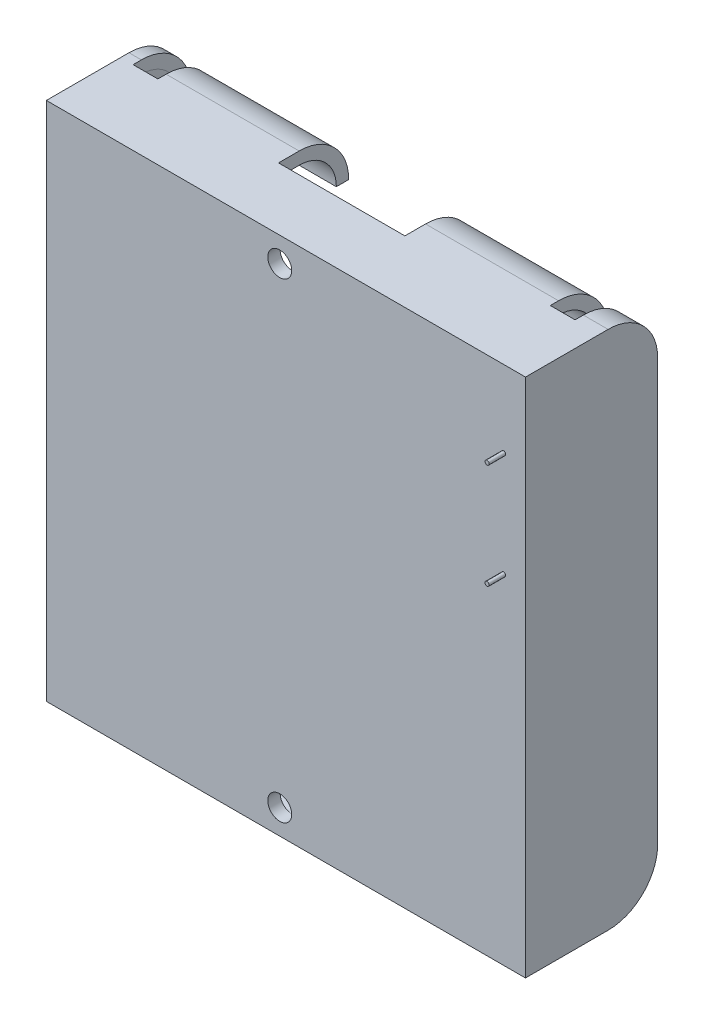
ISO-10303-21;
HEADER;
FILE_DESCRIPTION(('STEP AP214'),'2;1');
FILE_NAME('part.step','',(''),(''),'','','');
FILE_SCHEMA(('AUTOMOTIVE_DESIGN { 1 0 10303 214 1 1 1 1 }'));
ENDSEC;
DATA;
#1=APPLICATION_CONTEXT('core data for automotive mechanical design processes');
#2=APPLICATION_PROTOCOL_DEFINITION('international standard','automotive_design',2000,#1);
#3=PRODUCT_CONTEXT('',#1,'mechanical');
#4=PRODUCT('Part','Part','',(#3));
#5=PRODUCT_RELATED_PRODUCT_CATEGORY('part','',(#4));
#6=PRODUCT_DEFINITION_FORMATION('','',#4);
#7=PRODUCT_DEFINITION_CONTEXT('part definition',#1,'design');
#8=PRODUCT_DEFINITION('design','',#6,#7);
#9=PRODUCT_DEFINITION_SHAPE('','',#8);
#10=(LENGTH_UNIT() NAMED_UNIT(*) SI_UNIT(.MILLI.,.METRE.));
#11=(NAMED_UNIT(*) PLANE_ANGLE_UNIT() SI_UNIT($,.RADIAN.));
#12=(NAMED_UNIT(*) SI_UNIT($,.STERADIAN.) SOLID_ANGLE_UNIT());
#13=UNCERTAINTY_MEASURE_WITH_UNIT(LENGTH_MEASURE(1.E-05),#10,'distance_accuracy_value','');
#14=(GEOMETRIC_REPRESENTATION_CONTEXT(3) GLOBAL_UNCERTAINTY_ASSIGNED_CONTEXT((#13)) GLOBAL_UNIT_ASSIGNED_CONTEXT((#10,
#11,#12)) REPRESENTATION_CONTEXT('',''));
#15=CARTESIAN_POINT('',(0.,0.,0.));
#16=DIRECTION('',(0.,0.,1.));
#17=DIRECTION('',(1.,0.,0.));
#18=AXIS2_PLACEMENT_3D('',#15,#16,#17);
#19=CARTESIAN_POINT('',(-28.25,34.2499997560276,-16.));
#20=DIRECTION('',(0.,0.,1.));
#21=DIRECTION('',(1.,0.,0.));
#22=AXIS2_PLACEMENT_3D('',#19,#20,#21);
#23=PLANE('',#22);
#24=DIRECTION('',(-1.,0.,0.));
#25=VECTOR('',#24,1.);
#26=CARTESIAN_POINT('',(28.2484490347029,-13.0500002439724,-16.));
#27=LINE('',#26,#25);
#28=CARTESIAN_POINT('',(28.2453273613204,-13.0500002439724,-16.));
#29=VERTEX_POINT('',#28);
#30=CARTESIAN_POINT('',(28.244369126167,-13.0500002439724,-16.));
#31=VERTEX_POINT('',#30);
#32=EDGE_CURVE('E614',#29,#31,#27,.T.);
#33=ORIENTED_EDGE('',*,*,#32,.T.);
#34=DIRECTION('',(0.,-1.,0.));
#35=VECTOR('',#34,1.);
#36=CARTESIAN_POINT('',(28.244369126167,21.9499997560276,-16.));
#37=LINE('',#36,#35);
#38=CARTESIAN_POINT('',(28.244369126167,-12.0500002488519,-16.));
#39=VERTEX_POINT('',#38);
#40=EDGE_CURVE('E511',#39,#31,#37,.T.);
#41=ORIENTED_EDGE('',*,*,#40,.F.);
#42=DIRECTION('',(1.,0.,0.));
#43=VECTOR('',#42,1.);
#44=CARTESIAN_POINT('',(28.248350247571,-12.0500002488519,-16.));
#45=LINE('',#44,#43);
#46=CARTESIAN_POINT('',(28.2454261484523,-12.0500002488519,-16.));
#47=VERTEX_POINT('',#46);
#48=EDGE_CURVE('E616',#39,#47,#45,.T.);
#49=ORIENTED_EDGE('',*,*,#48,.T.);
#50=DIRECTION('',(9.87871318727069E-05,0.999999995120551,0.));
#51=VECTOR('',#50,1.);
#52=CARTESIAN_POINT('',(28.2499994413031,34.2444182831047,-16.));
#53=LINE('',#52,#51);
#54=CARTESIAN_POINT('',(28.2468388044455,2.24999975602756,-16.));
#55=VERTEX_POINT('',#54);
#56=EDGE_CURVE('E947',#47,#55,#53,.T.);
#57=ORIENTED_EDGE('',*,*,#56,.T.);
#58=DIRECTION('',(-1.,0.,0.));
#59=VECTOR('',#58,1.);
#60=CARTESIAN_POINT('',(28.248350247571,2.24999975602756,-16.));
#61=LINE('',#60,#59);
#62=CARTESIAN_POINT('',(28.244369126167,2.24999975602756,-16.));
#63=VERTEX_POINT('',#62);
#64=EDGE_CURVE('E590',#55,#63,#61,.T.);
#65=ORIENTED_EDGE('',*,*,#64,.T.);
#66=CARTESIAN_POINT('',(28.244369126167,3.24999975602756,-16.));
#67=VERTEX_POINT('',#66);
#68=EDGE_CURVE('E529',#67,#63,#37,.T.);
#69=ORIENTED_EDGE('',*,*,#68,.F.);
#70=DIRECTION('',(1.,0.,0.));
#71=VECTOR('',#70,1.);
#72=CARTESIAN_POINT('',(28.248350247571,3.24999975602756,-16.));
#73=LINE('',#72,#71);
#74=CARTESIAN_POINT('',(28.2469375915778,3.24999975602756,-16.));
#75=VERTEX_POINT('',#74);
#76=EDGE_CURVE('E593',#67,#75,#73,.T.);
#77=ORIENTED_EDGE('',*,*,#76,.T.);
#78=CARTESIAN_POINT('',(28.248350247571,17.549999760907,-16.));
#79=VERTEX_POINT('',#78);
#80=EDGE_CURVE('E948',#75,#79,#53,.T.);
#81=ORIENTED_EDGE('',*,*,#80,.T.);
#82=DIRECTION('',(-1.,0.,0.));
#83=VECTOR('',#82,1.);
#84=CARTESIAN_POINT('',(28.248350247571,17.549999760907,-16.));
#85=LINE('',#84,#83);
#86=CARTESIAN_POINT('',(28.244369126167,17.549999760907,-16.));
#87=VERTEX_POINT('',#86);
#88=EDGE_CURVE('E631',#79,#87,#85,.T.);
#89=ORIENTED_EDGE('',*,*,#88,.T.);
#90=CARTESIAN_POINT('',(28.244369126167,18.5499997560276,-16.));
#91=VERTEX_POINT('',#90);
#92=EDGE_CURVE('E531',#91,#87,#37,.T.);
#93=ORIENTED_EDGE('',*,*,#92,.F.);
#94=DIRECTION('',(1.,0.,0.));
#95=VECTOR('',#94,1.);
#96=CARTESIAN_POINT('',(28.2484490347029,18.5499997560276,-16.));
#97=LINE('',#96,#95);
#98=CARTESIAN_POINT('',(28.2484490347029,18.5499997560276,-16.));
#99=VERTEX_POINT('',#98);
#100=EDGE_CURVE('E634',#91,#99,#97,.T.);
#101=ORIENTED_EDGE('',*,*,#100,.T.);
#102=CARTESIAN_POINT('',(28.2494072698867,28.2499997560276,-16.));
#103=VERTEX_POINT('',#102);
#104=EDGE_CURVE('E931',#99,#103,#53,.T.);
#105=ORIENTED_EDGE('',*,*,#104,.T.);
#106=DIRECTION('',(-1.,0.,0.));
#107=VECTOR('',#106,1.);
#108=CARTESIAN_POINT('',(29.75,28.2499997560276,-16.));
#109=LINE('',#108,#107);
#110=CARTESIAN_POINT('',(29.7494072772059,28.2499997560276,-16.));
#111=VERTEX_POINT('',#110);
#112=EDGE_CURVE('E991',#103,#111,#109,.F.);
#113=ORIENTED_EDGE('',*,*,#112,.T.);
#114=DIRECTION('',(9.87871318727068E-05,0.999999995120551,0.));
#115=VECTOR('',#114,1.);
#116=CARTESIAN_POINT('',(29.75,34.2499997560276,-16.));
#117=LINE('',#116,#115);
#118=CARTESIAN_POINT('',(29.7443691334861,-22.7499999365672,-16.));
#119=VERTEX_POINT('',#118);
#120=EDGE_CURVE('E971',#119,#111,#117,.T.);
#121=ORIENTED_EDGE('',*,*,#120,.F.);
#122=DIRECTION('',(1.,0.,0.));
#123=VECTOR('',#122,1.);
#124=CARTESIAN_POINT('',(-28.256223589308,-22.7499999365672,-16.));
#125=LINE('',#124,#123);
#126=CARTESIAN_POINT('',(28.244369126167,-22.7499999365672,-16.));
#127=VERTEX_POINT('',#126);
#128=EDGE_CURVE('E996',#119,#127,#125,.F.);
#129=ORIENTED_EDGE('',*,*,#128,.T.);
#130=EDGE_CURVE('E887',#127,#29,#53,.T.);
#131=ORIENTED_EDGE('',*,*,#130,.T.);
#132=EDGE_LOOP('',(#33,#41,#49,#57,#65,#69,#77,#81,#89,#93,#101,#105,#113,#121,#129,#131));
#133=FACE_BOUND('',#132,.T.);
#134=ADVANCED_FACE('F32',(#133),#23,.F.);
#135=CARTESIAN_POINT('',(28.2500000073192,34.2501479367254,-16.));
#136=DIRECTION('',(0.999999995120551,-9.87871318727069E-05,0.));
#137=DIRECTION('',(9.87871318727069E-05,0.999999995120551,0.));
#138=AXIS2_PLACEMENT_3D('',#135,#136,#137);
#139=PLANE('',#138);
#140=DIRECTION('',(0.,0.,1.));
#141=VECTOR('',#140,1.);
#142=CARTESIAN_POINT('',(28.2468388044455,2.24999975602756,-16.));
#143=LINE('',#142,#141);
#144=CARTESIAN_POINT('',(28.2468388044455,2.24999975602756,-1.5));
#145=VERTEX_POINT('',#144);
#146=EDGE_CURVE('E603',#55,#145,#143,.T.);
#147=ORIENTED_EDGE('',*,*,#146,.F.);
#148=ORIENTED_EDGE('',*,*,#56,.F.);
#149=DIRECTION('',(0.,0.,-1.));
#150=VECTOR('',#149,1.);
#151=CARTESIAN_POINT('',(28.2454261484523,-12.0500002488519,-16.));
#152=LINE('',#151,#150);
#153=CARTESIAN_POINT('',(28.2454261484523,-12.0500002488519,-1.5));
#154=VERTEX_POINT('',#153);
#155=EDGE_CURVE('E622',#154,#47,#152,.T.);
#156=ORIENTED_EDGE('',*,*,#155,.F.);
#157=DIRECTION('',(9.87871318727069E-05,0.999999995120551,0.));
#158=VECTOR('',#157,1.);
#159=CARTESIAN_POINT('',(28.2499994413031,34.2444182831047,-1.5));
#160=LINE('',#159,#158);
#161=EDGE_CURVE('E920',#154,#145,#160,.T.);
#162=ORIENTED_EDGE('',*,*,#161,.T.);
#163=EDGE_LOOP('',(#147,#148,#156,#162));
#164=FACE_BOUND('',#163,.T.);
#165=ADVANCED_FACE('F1173',(#164),#139,.F.);
#166=DIRECTION('',(0.,0.,-1.));
#167=VECTOR('',#166,1.);
#168=CARTESIAN_POINT('',(28.2469375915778,3.24999975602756,-16.));
#169=LINE('',#168,#167);
#170=CARTESIAN_POINT('',(28.2469375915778,3.24999975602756,-1.5));
#171=VERTEX_POINT('',#170);
#172=EDGE_CURVE('E597',#171,#75,#169,.T.);
#173=ORIENTED_EDGE('',*,*,#172,.F.);
#174=CARTESIAN_POINT('',(28.248350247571,17.549999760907,-1.5));
#175=VERTEX_POINT('',#174);
#176=EDGE_CURVE('E921',#171,#175,#160,.T.);
#177=ORIENTED_EDGE('',*,*,#176,.T.);
#178=DIRECTION('',(0.,0.,1.));
#179=VECTOR('',#178,1.);
#180=CARTESIAN_POINT('',(28.248350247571,17.549999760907,-16.));
#181=LINE('',#180,#179);
#182=EDGE_CURVE('E641',#79,#175,#181,.T.);
#183=ORIENTED_EDGE('',*,*,#182,.F.);
#184=ORIENTED_EDGE('',*,*,#80,.F.);
#185=EDGE_LOOP('',(#173,#177,#183,#184));
#186=FACE_BOUND('',#185,.T.);
#187=ADVANCED_FACE('F1263',(#186),#139,.F.);
#188=CARTESIAN_POINT('',(-28.25,34.2499997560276,-1.5));
#189=DIRECTION('',(0.,0.,1.));
#190=DIRECTION('',(1.,0.,0.));
#191=AXIS2_PLACEMENT_3D('',#188,#189,#190);
#192=PLANE('',#191);
#193=CARTESIAN_POINT('',(0.,-25.7500000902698,-1.50000000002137));
#194=DIRECTION('',(0.,0.,-1.));
#195=DIRECTION('',(-1.,0.,0.));
#196=AXIS2_PLACEMENT_3D('',#193,#194,#195);
#197=CIRCLE('',#196,1.45);
#198=CARTESIAN_POINT('',(-1.45000000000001,-25.7500000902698,-1.50000000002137));
#199=VERTEX_POINT('',#198);
#200=EDGE_CURVE('E658',#199,#199,#197,.T.);
#201=ORIENTED_EDGE('',*,*,#200,.F.);
#202=EDGE_LOOP('',(#201));
#203=FACE_BOUND('',#202,.T.);
#204=DIRECTION('',(-1.,0.,0.));
#205=VECTOR('',#204,1.);
#206=CARTESIAN_POINT('',(28.248350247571,2.24999975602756,-1.5));
#207=LINE('',#206,#205);
#208=CARTESIAN_POINT('',(-26.7531611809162,2.24999975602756,-1.5));
#209=VERTEX_POINT('',#208);
#210=EDGE_CURVE('E586',#145,#209,#207,.T.);
#211=ORIENTED_EDGE('',*,*,#210,.F.);
#212=ORIENTED_EDGE('',*,*,#161,.F.);
#213=DIRECTION('',(1.,0.,0.));
#214=VECTOR('',#213,1.);
#215=CARTESIAN_POINT('',(28.248350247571,-12.0500002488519,-1.5));
#216=LINE('',#215,#214);
#217=CARTESIAN_POINT('',(-26.7516497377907,-12.0500002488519,-1.5));
#218=VERTEX_POINT('',#217);
#219=EDGE_CURVE('E611',#218,#154,#216,.T.);
#220=ORIENTED_EDGE('',*,*,#219,.F.);
#221=DIRECTION('',(0.,1.,0.));
#222=VECTOR('',#221,1.);
#223=CARTESIAN_POINT('',(-26.7516497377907,-13.0500002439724,-1.5));
#224=LINE('',#223,#222);
#225=CARTESIAN_POINT('',(-26.7516497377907,-13.0500002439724,-1.5));
#226=VERTEX_POINT('',#225);
#227=EDGE_CURVE('E608',#226,#218,#224,.T.);
#228=ORIENTED_EDGE('',*,*,#227,.F.);
#229=DIRECTION('',(-1.,0.,0.));
#230=VECTOR('',#229,1.);
#231=CARTESIAN_POINT('',(28.2484490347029,-13.0500002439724,-1.5));
#232=LINE('',#231,#230);
#233=CARTESIAN_POINT('',(28.2453273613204,-13.0500002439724,-1.5));
#234=VERTEX_POINT('',#233);
#235=EDGE_CURVE('E605',#234,#226,#232,.T.);
#236=ORIENTED_EDGE('',*,*,#235,.F.);
#237=CARTESIAN_POINT('',(28.2439245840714,-27.2499999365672,-1.5));
#238=VERTEX_POINT('',#237);
#239=EDGE_CURVE('E910',#238,#234,#160,.T.);
#240=ORIENTED_EDGE('',*,*,#239,.F.);
#241=DIRECTION('',(1.,0.,0.));
#242=VECTOR('',#241,1.);
#243=CARTESIAN_POINT('',(-28.25,-27.2499999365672,-1.5));
#244=LINE('',#243,#242);
#245=CARTESIAN_POINT('',(-26.7560754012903,-27.2499999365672,-1.5));
#246=VERTEX_POINT('',#245);
#247=EDGE_CURVE('E891',#246,#238,#244,.T.);
#248=ORIENTED_EDGE('',*,*,#247,.F.);
#249=DIRECTION('',(-9.87871318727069E-05,-0.999999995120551,0.));
#250=VECTOR('',#249,1.);
#251=CARTESIAN_POINT('',(-26.7500000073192,34.2498515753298,-1.5));
#252=LINE('',#251,#250);
#253=EDGE_CURVE('E868',#209,#246,#252,.T.);
#254=ORIENTED_EDGE('',*,*,#253,.F.);
#255=EDGE_LOOP('',(#211,#212,#220,#228,#236,#240,#248,#254));
#256=FACE_BOUND('',#255,.T.);
#257=ADVANCED_FACE('F1070',(#203,#256),#192,.F.);
#258=DIRECTION('',(1.,0.,0.));
#259=VECTOR('',#258,1.);
#260=CARTESIAN_POINT('',(28.248350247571,3.24999975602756,-1.5));
#261=LINE('',#260,#259);
#262=CARTESIAN_POINT('',(-26.7530623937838,3.24999975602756,-1.5));
#263=VERTEX_POINT('',#262);
#264=EDGE_CURVE('E588',#263,#171,#261,.T.);
#265=ORIENTED_EDGE('',*,*,#264,.F.);
#266=CARTESIAN_POINT('',(-26.7516497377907,17.5499997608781,-1.5));
#267=VERTEX_POINT('',#266);
#268=EDGE_CURVE('E892',#267,#263,#252,.T.);
#269=ORIENTED_EDGE('',*,*,#268,.F.);
#270=DIRECTION('',(-1.,0.,0.));
#271=VECTOR('',#270,1.);
#272=CARTESIAN_POINT('',(28.248350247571,17.549999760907,-1.5));
#273=LINE('',#272,#271);
#274=EDGE_CURVE('E628',#175,#267,#273,.T.);
#275=ORIENTED_EDGE('',*,*,#274,.F.);
#276=ORIENTED_EDGE('',*,*,#176,.F.);
#277=EDGE_LOOP('',(#265,#269,#275,#276));
#278=FACE_BOUND('',#277,.T.);
#279=ADVANCED_FACE('F1407',(#278),#192,.F.);
#280=CARTESIAN_POINT('',(-26.7500000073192,34.2498515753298,-16.));
#281=DIRECTION('',(-0.999999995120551,9.87871318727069E-05,0.));
#282=DIRECTION('',(-9.87871318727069E-05,-0.999999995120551,0.));
#283=AXIS2_PLACEMENT_3D('',#280,#281,#282);
#284=PLANE('',#283);
#285=DIRECTION('',(0.,0.,-1.));
#286=VECTOR('',#285,1.);
#287=CARTESIAN_POINT('',(-26.7546726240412,-13.0500002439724,-16.));
#288=LINE('',#287,#286);
#289=CARTESIAN_POINT('',(-26.7546726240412,-13.0500002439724,-15.9991855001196));
#290=VERTEX_POINT('',#289);
#291=CARTESIAN_POINT('',(-26.7546726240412,-13.0500002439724,-16.));
#292=VERTEX_POINT('',#291);
#293=EDGE_CURVE('E581',#290,#292,#288,.T.);
#294=ORIENTED_EDGE('',*,*,#293,.F.);
#295=DIRECTION('',(9.87871315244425E-05,0.99999999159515,8.39690617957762E-05));
#296=VECTOR('',#295,1.);
#297=CARTESIAN_POINT('',(-26.7500000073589,34.249851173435,-15.9952137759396));
#298=LINE('',#297,#296);
#299=CARTESIAN_POINT('',(-26.7531611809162,2.24999975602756,-15.9979007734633));
#300=VERTEX_POINT('',#299);
#301=EDGE_CURVE('E556',#290,#300,#298,.T.);
#302=ORIENTED_EDGE('',*,*,#301,.T.);
#303=DIRECTION('',(0.,0.,-1.));
#304=VECTOR('',#303,1.);
#305=CARTESIAN_POINT('',(-26.7531611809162,2.24999975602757,-16.));
#306=LINE('',#305,#304);
#307=EDGE_CURVE('E600',#209,#300,#306,.T.);
#308=ORIENTED_EDGE('',*,*,#307,.F.);
#309=ORIENTED_EDGE('',*,*,#253,.T.);
#310=DIRECTION('',(0.,0.,1.));
#311=VECTOR('',#310,1.);
#312=CARTESIAN_POINT('',(-26.7560754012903,-27.2499999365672,-16.));
#313=LINE('',#312,#311);
#314=CARTESIAN_POINT('',(-26.7560754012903,-27.2499999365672,-10.));
#315=VERTEX_POINT('',#314);
#316=EDGE_CURVE('E883',#315,#246,#313,.T.);
#317=ORIENTED_EDGE('',*,*,#316,.F.);
#318=CARTESIAN_POINT('',(-26.7556308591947,-22.7499999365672,-10.));
#319=DIRECTION('',(-0.999999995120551,9.87871318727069E-05,0.));
#320=DIRECTION('',(-9.87871318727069E-05,-0.999999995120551,0.));
#321=AXIS2_PLACEMENT_3D('',#318,#319,#320);
#322=ELLIPSE('',#321,4.50000002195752,4.5);
#323=CARTESIAN_POINT('',(-26.7556308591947,-22.7499999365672,-14.5));
#324=VERTEX_POINT('',#323);
#325=EDGE_CURVE('E880',#324,#315,#322,.T.);
#326=ORIENTED_EDGE('',*,*,#325,.F.);
#327=DIRECTION('',(0.,0.,-1.));
#328=VECTOR('',#327,1.);
#329=CARTESIAN_POINT('',(-26.7556308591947,-22.7499999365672,-16.));
#330=LINE('',#329,#328);
#331=CARTESIAN_POINT('',(-26.7556308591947,-22.7499999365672,-16.));
#332=VERTEX_POINT('',#331);
#333=EDGE_CURVE('E939',#324,#332,#330,.T.);
#334=ORIENTED_EDGE('',*,*,#333,.T.);
#335=DIRECTION('',(-9.87871318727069E-05,-0.999999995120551,0.));
#336=VECTOR('',#335,1.);
#337=CARTESIAN_POINT('',(-26.7500000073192,34.2498515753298,-16.));
#338=LINE('',#337,#336);
#339=EDGE_CURVE('E909',#292,#332,#338,.T.);
#340=ORIENTED_EDGE('',*,*,#339,.F.);
#341=EDGE_LOOP('',(#294,#302,#308,#309,#317,#326,#334,#340));
#342=FACE_BOUND('',#341,.T.);
#343=ADVANCED_FACE('F1059',(#342),#284,.F.);
#344=DIRECTION('',(0.,0.,1.));
#345=VECTOR('',#344,1.);
#346=CARTESIAN_POINT('',(-26.7530623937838,3.24999975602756,-16.));
#347=LINE('',#346,#345);
#348=CARTESIAN_POINT('',(-26.7530623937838,3.24999975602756,-15.9978168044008));
#349=VERTEX_POINT('',#348);
#350=EDGE_CURVE('E595',#349,#263,#347,.T.);
#351=ORIENTED_EDGE('',*,*,#350,.F.);
#352=DIRECTION('',(9.87871315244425E-05,0.99999999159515,8.39690617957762E-05));
#353=VECTOR('',#352,1.);
#354=CARTESIAN_POINT('',(-26.7500000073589,34.249851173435,-15.9952137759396));
#355=LINE('',#354,#353);
#356=CARTESIAN_POINT('',(-26.7516497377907,17.549999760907,-15.9966160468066));
#357=VERTEX_POINT('',#356);
#358=EDGE_CURVE('E547',#349,#357,#355,.T.);
#359=ORIENTED_EDGE('',*,*,#358,.T.);
#360=DIRECTION('',(0.,0.,1.));
#361=VECTOR('',#360,1.);
#362=CARTESIAN_POINT('',(-26.7516497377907,17.549999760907,-16.));
#363=LINE('',#362,#361);
#364=EDGE_CURVE('E639',#357,#267,#363,.T.);
#365=ORIENTED_EDGE('',*,*,#364,.T.);
#366=ORIENTED_EDGE('',*,*,#268,.T.);
#367=EDGE_LOOP('',(#351,#359,#365,#366));
#368=FACE_BOUND('',#367,.T.);
#369=ADVANCED_FACE('F1049',(#368),#284,.F.);
#370=DIRECTION('',(0.,0.,1.));
#371=VECTOR('',#370,1.);
#372=CARTESIAN_POINT('',(28.2453273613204,-13.0500002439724,-16.));
#373=LINE('',#372,#371);
#374=EDGE_CURVE('E625',#29,#234,#373,.T.);
#375=ORIENTED_EDGE('',*,*,#374,.F.);
#376=ORIENTED_EDGE('',*,*,#130,.F.);
#377=DIRECTION('',(0.,0.,-1.));
#378=VECTOR('',#377,1.);
#379=CARTESIAN_POINT('',(28.244369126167,-22.7499999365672,-16.));
#380=LINE('',#379,#378);
#381=CARTESIAN_POINT('',(28.244369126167,-22.7499999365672,-14.5));
#382=VERTEX_POINT('',#381);
#383=EDGE_CURVE('E944',#382,#127,#380,.T.);
#384=ORIENTED_EDGE('',*,*,#383,.F.);
#385=CARTESIAN_POINT('',(28.244369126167,-22.7499999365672,-10.));
#386=DIRECTION('',(0.999999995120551,-9.87871318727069E-05,0.));
#387=DIRECTION('',(-9.87871318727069E-05,-0.999999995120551,0.));
#388=AXIS2_PLACEMENT_3D('',#385,#386,#387);
#389=ELLIPSE('',#388,4.50000002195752,4.5);
#390=CARTESIAN_POINT('',(28.2439245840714,-27.2499999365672,-10.));
#391=VERTEX_POINT('',#390);
#392=EDGE_CURVE('E912',#391,#382,#389,.T.);
#393=ORIENTED_EDGE('',*,*,#392,.F.);
#394=DIRECTION('',(0.,0.,1.));
#395=VECTOR('',#394,1.);
#396=CARTESIAN_POINT('',(28.2439245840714,-27.2499999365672,-16.));
#397=LINE('',#396,#395);
#398=EDGE_CURVE('E886',#391,#238,#397,.T.);
#399=ORIENTED_EDGE('',*,*,#398,.T.);
#400=ORIENTED_EDGE('',*,*,#239,.T.);
#401=EDGE_LOOP('',(#375,#376,#384,#393,#399,#400));
#402=FACE_BOUND('',#401,.T.);
#403=ADVANCED_FACE('F1073',(#402),#139,.F.);
#404=DIRECTION('',(0.,0.,1.));
#405=VECTOR('',#404,1.);
#406=CARTESIAN_POINT('',(-26.7515509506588,18.5499997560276,-16.));
#407=LINE('',#406,#405);
#408=CARTESIAN_POINT('',(-26.7515509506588,18.5499997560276,-15.9965320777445));
#409=VERTEX_POINT('',#408);
#410=CARTESIAN_POINT('',(-26.7515509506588,18.5499997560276,-1.5));
#411=VERTEX_POINT('',#410);
#412=EDGE_CURVE('E644',#409,#411,#407,.T.);
#413=ORIENTED_EDGE('',*,*,#412,.F.);
#414=DIRECTION('',(9.87871315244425E-05,0.99999999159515,8.39690617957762E-05));
#415=VECTOR('',#414,1.);
#416=CARTESIAN_POINT('',(-26.7500000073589,34.249851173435,-15.9952137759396));
#417=LINE('',#416,#415);
#418=CARTESIAN_POINT('',(-26.7512150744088,21.9499997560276,-15.996246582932));
#419=VERTEX_POINT('',#418);
#420=EDGE_CURVE('E567',#409,#419,#417,.T.);
#421=ORIENTED_EDGE('',*,*,#420,.T.);
#422=DIRECTION('',(0.,0.,-1.));
#423=VECTOR('',#422,1.);
#424=CARTESIAN_POINT('',(-26.7512150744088,21.9499997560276,-16.));
#425=LINE('',#424,#423);
#426=CARTESIAN_POINT('',(-26.7512150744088,21.9499997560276,-16.));
#427=VERTEX_POINT('',#426);
#428=EDGE_CURVE('E583',#419,#427,#425,.T.);
#429=ORIENTED_EDGE('',*,*,#428,.T.);
#430=CARTESIAN_POINT('',(-26.750592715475,28.2499997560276,-16.));
#431=VERTEX_POINT('',#430);
#432=EDGE_CURVE('E928',#431,#427,#338,.T.);
#433=ORIENTED_EDGE('',*,*,#432,.F.);
#434=DIRECTION('',(0.,0.,-1.));
#435=VECTOR('',#434,1.);
#436=CARTESIAN_POINT('',(-26.750592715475,28.2499997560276,-16.));
#437=LINE('',#436,#435);
#438=CARTESIAN_POINT('',(-26.750592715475,28.2499997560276,-14.5));
#439=VERTEX_POINT('',#438);
#440=EDGE_CURVE('E932',#439,#431,#437,.T.);
#441=ORIENTED_EDGE('',*,*,#440,.F.);
#442=CARTESIAN_POINT('',(-26.750592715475,28.2499997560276,-10.));
#443=DIRECTION('',(-0.999999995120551,9.87871318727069E-05,0.));
#444=DIRECTION('',(9.87871318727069E-05,0.999999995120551,0.));
#445=AXIS2_PLACEMENT_3D('',#442,#443,#444);
#446=ELLIPSE('',#445,4.50000002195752,4.5);
#447=CARTESIAN_POINT('',(-26.7501481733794,32.7499997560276,-10.));
#448=VERTEX_POINT('',#447);
#449=EDGE_CURVE('E878',#448,#439,#446,.T.);
#450=ORIENTED_EDGE('',*,*,#449,.F.);
#451=DIRECTION('',(0.,0.,1.));
#452=VECTOR('',#451,1.);
#453=CARTESIAN_POINT('',(-26.7501481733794,32.7499997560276,-16.));
#454=LINE('',#453,#452);
#455=CARTESIAN_POINT('',(-26.7501481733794,32.7499997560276,-1.5));
#456=VERTEX_POINT('',#455);
#457=EDGE_CURVE('E893',#448,#456,#454,.T.);
#458=ORIENTED_EDGE('',*,*,#457,.T.);
#459=EDGE_CURVE('E888',#456,#411,#252,.T.);
#460=ORIENTED_EDGE('',*,*,#459,.T.);
#461=EDGE_LOOP('',(#413,#421,#429,#433,#441,#450,#458,#460));
#462=FACE_BOUND('',#461,.T.);
#463=ADVANCED_FACE('F1155',(#462),#284,.F.);
#464=DIRECTION('',(0.,0.,1.));
#465=VECTOR('',#464,1.);
#466=CARTESIAN_POINT('',(28.2484490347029,18.5499997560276,-16.));
#467=LINE('',#466,#465);
#468=CARTESIAN_POINT('',(28.2484490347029,18.5499997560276,-1.5));
#469=VERTEX_POINT('',#468);
#470=EDGE_CURVE('E636',#99,#469,#467,.T.);
#471=ORIENTED_EDGE('',*,*,#470,.T.);
#472=CARTESIAN_POINT('',(28.2498518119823,32.7499997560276,-1.5));
#473=VERTEX_POINT('',#472);
#474=EDGE_CURVE('E922',#469,#473,#160,.T.);
#475=ORIENTED_EDGE('',*,*,#474,.T.);
#476=DIRECTION('',(0.,0.,1.));
#477=VECTOR('',#476,1.);
#478=CARTESIAN_POINT('',(28.2498518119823,32.7499997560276,-16.));
#479=LINE('',#478,#477);
#480=CARTESIAN_POINT('',(28.2498518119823,32.7499997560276,-10.));
#481=VERTEX_POINT('',#480);
#482=EDGE_CURVE('E896',#481,#473,#479,.T.);
#483=ORIENTED_EDGE('',*,*,#482,.F.);
#484=CARTESIAN_POINT('',(28.2494072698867,28.2499997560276,-10.));
#485=DIRECTION('',(0.999999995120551,-9.87871318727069E-05,0.));
#486=DIRECTION('',(9.87871318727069E-05,0.999999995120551,0.));
#487=AXIS2_PLACEMENT_3D('',#484,#485,#486);
#488=ELLIPSE('',#487,4.50000002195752,4.5);
#489=CARTESIAN_POINT('',(28.2494072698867,28.2499997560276,-14.5));
#490=VERTEX_POINT('',#489);
#491=EDGE_CURVE('E915',#490,#481,#488,.T.);
#492=ORIENTED_EDGE('',*,*,#491,.F.);
#493=DIRECTION('',(0.,0.,-1.));
#494=VECTOR('',#493,1.);
#495=CARTESIAN_POINT('',(28.2494072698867,28.2499997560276,-16.));
#496=LINE('',#495,#494);
#497=EDGE_CURVE('E935',#490,#103,#496,.T.);
#498=ORIENTED_EDGE('',*,*,#497,.T.);
#499=ORIENTED_EDGE('',*,*,#104,.F.);
#500=EDGE_LOOP('',(#471,#475,#483,#492,#498,#499));
#501=FACE_BOUND('',#500,.T.);
#502=ADVANCED_FACE('F1178',(#501),#139,.F.);
#503=CARTESIAN_POINT('',(0.,31.2499999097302,-1.50000000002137));
#504=DIRECTION('',(0.,0.,-1.));
#505=DIRECTION('',(-1.,0.,0.));
#506=AXIS2_PLACEMENT_3D('',#503,#504,#505);
#507=CIRCLE('',#506,1.45);
#508=CARTESIAN_POINT('',(-1.44999999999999,31.2499999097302,-1.50000000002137));
#509=VERTEX_POINT('',#508);
#510=EDGE_CURVE('E664',#509,#509,#507,.T.);
#511=ORIENTED_EDGE('',*,*,#510,.F.);
#512=EDGE_LOOP('',(#511));
#513=FACE_BOUND('',#512,.T.);
#514=DIRECTION('',(1.,0.,0.));
#515=VECTOR('',#514,1.);
#516=CARTESIAN_POINT('',(-28.25,18.5499997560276,-1.5));
#517=LINE('',#516,#515);
#518=EDGE_CURVE('E1035',#411,#469,#517,.T.);
#519=ORIENTED_EDGE('',*,*,#518,.F.);
#520=ORIENTED_EDGE('',*,*,#459,.F.);
#521=DIRECTION('',(-1.,0.,0.));
#522=VECTOR('',#521,1.);
#523=CARTESIAN_POINT('',(-28.25,32.7499997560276,-1.5));
#524=LINE('',#523,#522);
#525=EDGE_CURVE('E906',#473,#456,#524,.T.);
#526=ORIENTED_EDGE('',*,*,#525,.F.);
#527=ORIENTED_EDGE('',*,*,#474,.F.);
#528=EDGE_LOOP('',(#519,#520,#526,#527));
#529=FACE_BOUND('',#528,.T.);
#530=ADVANCED_FACE('F1190',(#513,#529),#192,.F.);
#531=CARTESIAN_POINT('',(-28.25,34.2499997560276,0.));
#532=DIRECTION('',(0.,0.,1.));
#533=DIRECTION('',(1.,0.,0.));
#534=AXIS2_PLACEMENT_3D('',#531,#532,#533);
#535=PLANE('',#534);
#536=CARTESIAN_POINT('',(27.1,24.9499997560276,0.));
#537=DIRECTION('',(0.,0.,1.));
#538=DIRECTION('',(1.,0.,0.));
#539=AXIS2_PLACEMENT_3D('',#536,#537,#538);
#540=CIRCLE('',#539,0.25);
#541=CARTESIAN_POINT('',(27.35,24.9499997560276,0.));
#542=VERTEX_POINT('',#541);
#543=EDGE_CURVE('E652',#542,#542,#540,.T.);
#544=ORIENTED_EDGE('',*,*,#543,.F.);
#545=EDGE_LOOP('',(#544));
#546=FACE_BOUND('',#545,.T.);
#547=CARTESIAN_POINT('',(0.,-25.7500000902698,0.));
#548=DIRECTION('',(0.,0.,-1.));
#549=DIRECTION('',(-1.,0.,0.));
#550=AXIS2_PLACEMENT_3D('',#547,#548,#549);
#551=CIRCLE('',#550,1.45);
#552=CARTESIAN_POINT('',(-1.45000000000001,-25.7500000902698,0.));
#553=VERTEX_POINT('',#552);
#554=EDGE_CURVE('E661',#553,#553,#551,.T.);
#555=ORIENTED_EDGE('',*,*,#554,.T.);
#556=EDGE_LOOP('',(#555));
#557=FACE_BOUND('',#556,.T.);
#558=CARTESIAN_POINT('',(0.,31.2499999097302,0.));
#559=DIRECTION('',(0.,0.,-1.));
#560=DIRECTION('',(-1.,0.,0.));
#561=AXIS2_PLACEMENT_3D('',#558,#559,#560);
#562=CIRCLE('',#561,1.45);
#563=CARTESIAN_POINT('',(-1.44999999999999,31.2499999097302,0.));
#564=VERTEX_POINT('',#563);
#565=EDGE_CURVE('E667',#564,#564,#562,.T.);
#566=ORIENTED_EDGE('',*,*,#565,.T.);
#567=EDGE_LOOP('',(#566));
#568=FACE_BOUND('',#567,.T.);
#569=DIRECTION('',(-9.87871318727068E-05,-0.999999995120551,0.));
#570=VECTOR('',#569,1.);
#571=CARTESIAN_POINT('',(-28.25,34.2499997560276,0.));
#572=LINE('',#571,#570);
#573=CARTESIAN_POINT('',(-28.25,34.2499997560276,0.));
#574=VERTEX_POINT('',#573);
#575=CARTESIAN_POINT('',(-28.256223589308,-28.7499999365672,0.));
#576=VERTEX_POINT('',#575);
#577=EDGE_CURVE('E934',#574,#576,#572,.T.);
#578=ORIENTED_EDGE('',*,*,#577,.T.);
#579=DIRECTION('',(1.,0.,0.));
#580=VECTOR('',#579,1.);
#581=CARTESIAN_POINT('',(-28.256223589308,-28.7499999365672,0.));
#582=LINE('',#581,#580);
#583=CARTESIAN_POINT('',(29.743776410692,-28.7499999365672,0.));
#584=VERTEX_POINT('',#583);
#585=EDGE_CURVE('E959',#576,#584,#582,.T.);
#586=ORIENTED_EDGE('',*,*,#585,.T.);
#587=DIRECTION('',(9.87871318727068E-05,0.999999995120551,0.));
#588=VECTOR('',#587,1.);
#589=CARTESIAN_POINT('',(29.75,34.2499997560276,0.));
#590=LINE('',#589,#588);
#591=CARTESIAN_POINT('',(29.75,34.2499997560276,0.));
#592=VERTEX_POINT('',#591);
#593=EDGE_CURVE('E962',#584,#592,#590,.T.);
#594=ORIENTED_EDGE('',*,*,#593,.T.);
#595=DIRECTION('',(-1.,0.,0.));
#596=VECTOR('',#595,1.);
#597=CARTESIAN_POINT('',(-28.25,34.2499997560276,0.));
#598=LINE('',#597,#596);
#599=EDGE_CURVE('E965',#592,#574,#598,.T.);
#600=ORIENTED_EDGE('',*,*,#599,.T.);
#601=EDGE_LOOP('',(#578,#586,#594,#600));
#602=FACE_BOUND('',#601,.T.);
#603=CARTESIAN_POINT('',(27.1,12.2499997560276,0.));
#604=DIRECTION('',(0.,0.,1.));
#605=DIRECTION('',(1.,0.,0.));
#606=AXIS2_PLACEMENT_3D('',#603,#604,#605);
#607=CIRCLE('',#606,0.25);
#608=CARTESIAN_POINT('',(27.35,12.2499997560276,0.));
#609=VERTEX_POINT('',#608);
#610=EDGE_CURVE('E646',#609,#609,#607,.T.);
#611=ORIENTED_EDGE('',*,*,#610,.F.);
#612=EDGE_LOOP('',(#611));
#613=FACE_BOUND('',#612,.T.);
#614=ADVANCED_FACE('F1391',(#546,#557,#568,#602,#613),#535,.T.);
#615=CARTESIAN_POINT('',(-28.256223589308,-22.7499999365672,-10.));
#616=DIRECTION('',(-1.,0.,0.));
#617=DIRECTION('',(0.,0.,1.));
#618=AXIS2_PLACEMENT_3D('',#615,#616,#617);
#619=CYLINDRICAL_SURFACE('',#618,6.);
#620=CARTESIAN_POINT('',(26.75,-22.7499999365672,-10.));
#621=DIRECTION('',(1.,0.,0.));
#622=DIRECTION('',(0.,1.,0.));
#623=AXIS2_PLACEMENT_3D('',#620,#621,#622);
#624=CIRCLE('',#623,6.);
#625=CARTESIAN_POINT('',(26.75,-22.7499999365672,-16.));
#626=VERTEX_POINT('',#625);
#627=CARTESIAN_POINT('',(26.75,-28.7499999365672,-10.));
#628=VERTEX_POINT('',#627);
#629=EDGE_CURVE('E723',#626,#628,#624,.F.);
#630=ORIENTED_EDGE('',*,*,#629,.F.);
#631=DIRECTION('',(1.,0.,0.));
#632=VECTOR('',#631,1.);
#633=CARTESIAN_POINT('',(-28.256223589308,-22.7499999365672,-16.));
#634=LINE('',#633,#632);
#635=EDGE_CURVE('E875',#127,#626,#634,.F.);
#636=ORIENTED_EDGE('',*,*,#635,.F.);
#637=ORIENTED_EDGE('',*,*,#128,.F.);
#638=CARTESIAN_POINT('',(29.7443691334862,-22.7499999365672,-10.));
#639=DIRECTION('',(0.999999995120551,-9.87871318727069E-05,0.));
#640=DIRECTION('',(-9.87871318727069E-05,-0.999999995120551,0.));
#641=AXIS2_PLACEMENT_3D('',#638,#639,#640);
#642=ELLIPSE('',#641,6.00000002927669,6.);
#643=CARTESIAN_POINT('',(29.743776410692,-28.7499999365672,-10.));
#644=VERTEX_POINT('',#643);
#645=EDGE_CURVE('E989',#644,#119,#642,.T.);
#646=ORIENTED_EDGE('',*,*,#645,.F.);
#647=DIRECTION('',(1.,0.,0.));
#648=VECTOR('',#647,1.);
#649=CARTESIAN_POINT('',(29.743776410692,-28.7499999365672,-10.));
#650=LINE('',#649,#648);
#651=EDGE_CURVE('E977',#628,#644,#650,.T.);
#652=ORIENTED_EDGE('',*,*,#651,.F.);
#653=EDGE_LOOP('',(#630,#636,#637,#646,#652));
#654=FACE_BOUND('',#653,.T.);
#655=ADVANCED_FACE('F1085',(#654),#619,.T.);
#656=CARTESIAN_POINT('',(-28.25,28.2499997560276,-10.));
#657=DIRECTION('',(1.,0.,0.));
#658=DIRECTION('',(0.,1.,0.));
#659=AXIS2_PLACEMENT_3D('',#656,#657,#658);
#660=CYLINDRICAL_SURFACE('',#659,6.);
#661=CARTESIAN_POINT('',(26.75,28.2499997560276,-10.));
#662=DIRECTION('',(1.,0.,0.));
#663=DIRECTION('',(0.,1.,0.));
#664=AXIS2_PLACEMENT_3D('',#661,#662,#663);
#665=CIRCLE('',#664,6.);
#666=CARTESIAN_POINT('',(26.75,34.2499997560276,-10.));
#667=VERTEX_POINT('',#666);
#668=CARTESIAN_POINT('',(26.75,28.2499997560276,-16.));
#669=VERTEX_POINT('',#668);
#670=EDGE_CURVE('E734',#667,#669,#665,.F.);
#671=ORIENTED_EDGE('',*,*,#670,.F.);
#672=DIRECTION('',(-1.,0.,0.));
#673=VECTOR('',#672,1.);
#674=CARTESIAN_POINT('',(-28.25,34.2499997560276,-10.));
#675=LINE('',#674,#673);
#676=CARTESIAN_POINT('',(29.75,34.2499997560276,-10.));
#677=VERTEX_POINT('',#676);
#678=EDGE_CURVE('E1004',#677,#667,#675,.T.);
#679=ORIENTED_EDGE('',*,*,#678,.F.);
#680=CARTESIAN_POINT('',(29.7494072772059,28.2499997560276,-10.));
#681=DIRECTION('',(0.999999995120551,-9.87871318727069E-05,0.));
#682=DIRECTION('',(9.87871318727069E-05,0.999999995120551,0.));
#683=AXIS2_PLACEMENT_3D('',#680,#681,#682);
#684=ELLIPSE('',#683,6.00000002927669,6.);
#685=EDGE_CURVE('E986',#111,#677,#684,.T.);
#686=ORIENTED_EDGE('',*,*,#685,.F.);
#687=ORIENTED_EDGE('',*,*,#112,.F.);
#688=DIRECTION('',(-1.,0.,0.));
#689=VECTOR('',#688,1.);
#690=CARTESIAN_POINT('',(29.75,28.2499997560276,-16.));
#691=LINE('',#690,#689);
#692=EDGE_CURVE('E874',#669,#103,#691,.F.);
#693=ORIENTED_EDGE('',*,*,#692,.F.);
#694=EDGE_LOOP('',(#671,#679,#686,#687,#693));
#695=FACE_BOUND('',#694,.T.);
#696=ADVANCED_FACE('F1354',(#695),#660,.T.);
#697=CARTESIAN_POINT('',(29.75,28.2499997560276,-16.));
#698=DIRECTION('',(0.,1.,0.));
#699=DIRECTION('',(-1.,0.,0.));
#700=AXIS2_PLACEMENT_3D('',#697,#698,#699);
#701=PLANE('',#700);
#702=DIRECTION('',(1.,0.,0.));
#703=VECTOR('',#702,1.);
#704=CARTESIAN_POINT('',(0.74940727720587,28.2499997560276,-14.5));
#705=LINE('',#704,#703);
#706=CARTESIAN_POINT('',(26.75,28.2499997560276,-14.5));
#707=VERTEX_POINT('',#706);
#708=EDGE_CURVE('E941',#707,#490,#705,.T.);
#709=ORIENTED_EDGE('',*,*,#708,.F.);
#710=DIRECTION('',(0.,0.,-1.));
#711=VECTOR('',#710,1.);
#712=CARTESIAN_POINT('',(26.75,28.2499997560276,-16.));
#713=LINE('',#712,#711);
#714=EDGE_CURVE('E731',#707,#669,#713,.T.);
#715=ORIENTED_EDGE('',*,*,#714,.T.);
#716=ORIENTED_EDGE('',*,*,#692,.T.);
#717=ORIENTED_EDGE('',*,*,#497,.F.);
#718=EDGE_LOOP('',(#709,#715,#716,#717));
#719=FACE_BOUND('',#718,.T.);
#720=ADVANCED_FACE('F1348',(#719),#701,.F.);
#721=CARTESIAN_POINT('',(-28.256223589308,-22.7499999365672,-16.));
#722=DIRECTION('',(0.,-1.,0.));
#723=DIRECTION('',(1.,0.,0.));
#724=AXIS2_PLACEMENT_3D('',#721,#722,#723);
#725=PLANE('',#724);
#726=ORIENTED_EDGE('',*,*,#635,.T.);
#727=DIRECTION('',(0.,0.,1.));
#728=VECTOR('',#727,1.);
#729=CARTESIAN_POINT('',(26.75,-22.7499999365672,-16.));
#730=LINE('',#729,#728);
#731=CARTESIAN_POINT('',(26.75,-22.7499999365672,-14.5));
#732=VERTEX_POINT('',#731);
#733=EDGE_CURVE('E720',#626,#732,#730,.T.);
#734=ORIENTED_EDGE('',*,*,#733,.T.);
#735=DIRECTION('',(-1.,0.,0.));
#736=VECTOR('',#735,1.);
#737=CARTESIAN_POINT('',(0.744369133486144,-22.7499999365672,-14.5));
#738=LINE('',#737,#736);
#739=EDGE_CURVE('E951',#382,#732,#738,.T.);
#740=ORIENTED_EDGE('',*,*,#739,.F.);
#741=ORIENTED_EDGE('',*,*,#383,.T.);
#742=EDGE_LOOP('',(#726,#734,#740,#741));
#743=FACE_BOUND('',#742,.T.);
#744=ADVANCED_FACE('F1082',(#743),#725,.F.);
#745=CARTESIAN_POINT('',(-28.256223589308,-22.7499999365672,-10.));
#746=DIRECTION('',(-1.,0.,0.));
#747=DIRECTION('',(0.,0.,1.));
#748=AXIS2_PLACEMENT_3D('',#745,#746,#747);
#749=CYLINDRICAL_SURFACE('',#748,4.5);
#750=ORIENTED_EDGE('',*,*,#739,.T.);
#751=CARTESIAN_POINT('',(26.75,-22.7499999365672,-10.));
#752=DIRECTION('',(1.,0.,0.));
#753=DIRECTION('',(0.,1.,0.));
#754=AXIS2_PLACEMENT_3D('',#751,#752,#753);
#755=CIRCLE('',#754,4.5);
#756=CARTESIAN_POINT('',(26.75,-27.2499999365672,-10.));
#757=VERTEX_POINT('',#756);
#758=EDGE_CURVE('E717',#732,#757,#755,.F.);
#759=ORIENTED_EDGE('',*,*,#758,.T.);
#760=DIRECTION('',(1.,0.,0.));
#761=VECTOR('',#760,1.);
#762=CARTESIAN_POINT('',(-28.256223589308,-27.2499999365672,-10.));
#763=LINE('',#762,#761);
#764=EDGE_CURVE('E895',#757,#391,#763,.T.);
#765=ORIENTED_EDGE('',*,*,#764,.T.);
#766=ORIENTED_EDGE('',*,*,#392,.T.);
#767=EDGE_LOOP('',(#750,#759,#765,#766));
#768=FACE_BOUND('',#767,.T.);
#769=ADVANCED_FACE('F1251',(#768),#749,.F.);
#770=CARTESIAN_POINT('',(-28.25,28.2499997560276,-10.));
#771=DIRECTION('',(1.,0.,0.));
#772=DIRECTION('',(0.,1.,0.));
#773=AXIS2_PLACEMENT_3D('',#770,#771,#772);
#774=CYLINDRICAL_SURFACE('',#773,4.5);
#775=DIRECTION('',(-1.,0.,0.));
#776=VECTOR('',#775,1.);
#777=CARTESIAN_POINT('',(-28.25,32.7499997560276,-10.));
#778=LINE('',#777,#776);
#779=CARTESIAN_POINT('',(26.75,32.7499997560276,-10.));
#780=VERTEX_POINT('',#779);
#781=EDGE_CURVE('E901',#481,#780,#778,.T.);
#782=ORIENTED_EDGE('',*,*,#781,.T.);
#783=CARTESIAN_POINT('',(26.75,28.2499997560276,-10.));
#784=DIRECTION('',(1.,0.,0.));
#785=DIRECTION('',(0.,1.,0.));
#786=AXIS2_PLACEMENT_3D('',#783,#784,#785);
#787=CIRCLE('',#786,4.5);
#788=EDGE_CURVE('E728',#780,#707,#787,.F.);
#789=ORIENTED_EDGE('',*,*,#788,.T.);
#790=ORIENTED_EDGE('',*,*,#708,.T.);
#791=ORIENTED_EDGE('',*,*,#491,.T.);
#792=EDGE_LOOP('',(#782,#789,#790,#791));
#793=FACE_BOUND('',#792,.T.);
#794=ADVANCED_FACE('F1241',(#793),#774,.F.);
#795=CARTESIAN_POINT('',(-7.65,-22.7499999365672,-10.));
#796=DIRECTION('',(-1.,0.,0.));
#797=DIRECTION('',(0.,-1.,0.));
#798=AXIS2_PLACEMENT_3D('',#795,#796,#797);
#799=CIRCLE('',#798,6.);
#800=CARTESIAN_POINT('',(-7.65,-28.7499999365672,-10.));
#801=VERTEX_POINT('',#800);
#802=CARTESIAN_POINT('',(-7.65,-22.7499999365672,-16.));
#803=VERTEX_POINT('',#802);
#804=EDGE_CURVE('E788',#801,#803,#799,.F.);
#805=ORIENTED_EDGE('',*,*,#804,.F.);
#806=CARTESIAN_POINT('',(-23.75,-28.7499999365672,-10.));
#807=VERTEX_POINT('',#806);
#808=EDGE_CURVE('E987',#807,#801,#650,.T.);
#809=ORIENTED_EDGE('',*,*,#808,.F.);
#810=CARTESIAN_POINT('',(-23.75,-22.7499999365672,-10.));
#811=DIRECTION('',(1.,0.,0.));
#812=DIRECTION('',(0.,1.,0.));
#813=AXIS2_PLACEMENT_3D('',#810,#811,#812);
#814=CIRCLE('',#813,6.);
#815=CARTESIAN_POINT('',(-23.75,-22.7499999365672,-16.));
#816=VERTEX_POINT('',#815);
#817=EDGE_CURVE('E863',#816,#807,#814,.F.);
#818=ORIENTED_EDGE('',*,*,#817,.F.);
#819=EDGE_CURVE('E1116',#803,#816,#634,.F.);
#820=ORIENTED_EDGE('',*,*,#819,.F.);
#821=EDGE_LOOP('',(#805,#809,#818,#820));
#822=FACE_BOUND('',#821,.T.);
#823=ADVANCED_FACE('F1121',(#822),#619,.T.);
#824=CARTESIAN_POINT('',(-7.65,28.2499997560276,-10.));
#825=DIRECTION('',(-1.,0.,0.));
#826=DIRECTION('',(0.,-1.,0.));
#827=AXIS2_PLACEMENT_3D('',#824,#825,#826);
#828=CIRCLE('',#827,6.);
#829=CARTESIAN_POINT('',(-7.65,28.2499997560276,-16.));
#830=VERTEX_POINT('',#829);
#831=CARTESIAN_POINT('',(-7.65,34.2499997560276,-10.));
#832=VERTEX_POINT('',#831);
#833=EDGE_CURVE('E799',#830,#832,#828,.F.);
#834=ORIENTED_EDGE('',*,*,#833,.F.);
#835=CARTESIAN_POINT('',(-23.75,28.2499997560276,-16.));
#836=VERTEX_POINT('',#835);
#837=EDGE_CURVE('E873',#836,#830,#691,.F.);
#838=ORIENTED_EDGE('',*,*,#837,.F.);
#839=CARTESIAN_POINT('',(-23.75,28.2499997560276,-10.));
#840=DIRECTION('',(1.,0.,0.));
#841=DIRECTION('',(0.,1.,0.));
#842=AXIS2_PLACEMENT_3D('',#839,#840,#841);
#843=CIRCLE('',#842,6.);
#844=CARTESIAN_POINT('',(-23.75,34.2499997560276,-10.));
#845=VERTEX_POINT('',#844);
#846=EDGE_CURVE('E852',#845,#836,#843,.F.);
#847=ORIENTED_EDGE('',*,*,#846,.F.);
#848=EDGE_CURVE('E1220',#832,#845,#675,.T.);
#849=ORIENTED_EDGE('',*,*,#848,.F.);
#850=EDGE_LOOP('',(#834,#838,#847,#849));
#851=FACE_BOUND('',#850,.T.);
#852=ADVANCED_FACE('F1224',(#851),#660,.T.);
#853=ORIENTED_EDGE('',*,*,#837,.T.);
#854=DIRECTION('',(0.,0.,1.));
#855=VECTOR('',#854,1.);
#856=CARTESIAN_POINT('',(-7.65,28.2499997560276,-16.));
#857=LINE('',#856,#855);
#858=CARTESIAN_POINT('',(-7.65,28.2499997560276,-14.5));
#859=VERTEX_POINT('',#858);
#860=EDGE_CURVE('E796',#830,#859,#857,.T.);
#861=ORIENTED_EDGE('',*,*,#860,.T.);
#862=CARTESIAN_POINT('',(-23.75,28.2499997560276,-14.5));
#863=VERTEX_POINT('',#862);
#864=EDGE_CURVE('E940',#863,#859,#705,.T.);
#865=ORIENTED_EDGE('',*,*,#864,.F.);
#866=DIRECTION('',(0.,0.,-1.));
#867=VECTOR('',#866,1.);
#868=CARTESIAN_POINT('',(-23.75,28.2499997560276,-16.));
#869=LINE('',#868,#867);
#870=EDGE_CURVE('E849',#863,#836,#869,.T.);
#871=ORIENTED_EDGE('',*,*,#870,.T.);
#872=EDGE_LOOP('',(#853,#861,#865,#871));
#873=FACE_BOUND('',#872,.T.);
#874=ADVANCED_FACE('F1314',(#873),#701,.F.);
#875=CARTESIAN_POINT('',(-7.65,-22.7499999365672,-14.5));
#876=VERTEX_POINT('',#875);
#877=CARTESIAN_POINT('',(-23.75,-22.7499999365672,-14.5));
#878=VERTEX_POINT('',#877);
#879=EDGE_CURVE('E1118',#876,#878,#738,.T.);
#880=ORIENTED_EDGE('',*,*,#879,.F.);
#881=DIRECTION('',(0.,0.,-1.));
#882=VECTOR('',#881,1.);
#883=CARTESIAN_POINT('',(-7.65,-22.7499999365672,-16.));
#884=LINE('',#883,#882);
#885=EDGE_CURVE('E785',#876,#803,#884,.T.);
#886=ORIENTED_EDGE('',*,*,#885,.T.);
#887=ORIENTED_EDGE('',*,*,#819,.T.);
#888=DIRECTION('',(0.,0.,1.));
#889=VECTOR('',#888,1.);
#890=CARTESIAN_POINT('',(-23.75,-22.7499999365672,-16.));
#891=LINE('',#890,#889);
#892=EDGE_CURVE('E860',#816,#878,#891,.T.);
#893=ORIENTED_EDGE('',*,*,#892,.T.);
#894=EDGE_LOOP('',(#880,#886,#887,#893));
#895=FACE_BOUND('',#894,.T.);
#896=ADVANCED_FACE('F1115',(#895),#725,.F.);
#897=CARTESIAN_POINT('',(-23.75,-27.2499999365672,-10.));
#898=VERTEX_POINT('',#897);
#899=CARTESIAN_POINT('',(-7.65,-27.2499999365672,-10.));
#900=VERTEX_POINT('',#899);
#901=EDGE_CURVE('E925',#898,#900,#763,.T.);
#902=ORIENTED_EDGE('',*,*,#901,.T.);
#903=CARTESIAN_POINT('',(-7.65,-22.7499999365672,-10.));
#904=DIRECTION('',(-1.,0.,0.));
#905=DIRECTION('',(0.,-1.,0.));
#906=AXIS2_PLACEMENT_3D('',#903,#904,#905);
#907=CIRCLE('',#906,4.5);
#908=EDGE_CURVE('E782',#900,#876,#907,.F.);
#909=ORIENTED_EDGE('',*,*,#908,.T.);
#910=ORIENTED_EDGE('',*,*,#879,.T.);
#911=CARTESIAN_POINT('',(-23.75,-22.7499999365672,-10.));
#912=DIRECTION('',(1.,0.,0.));
#913=DIRECTION('',(0.,1.,0.));
#914=AXIS2_PLACEMENT_3D('',#911,#912,#913);
#915=CIRCLE('',#914,4.5);
#916=EDGE_CURVE('E854',#878,#898,#915,.F.);
#917=ORIENTED_EDGE('',*,*,#916,.T.);
#918=EDGE_LOOP('',(#902,#909,#910,#917));
#919=FACE_BOUND('',#918,.T.);
#920=ADVANCED_FACE('F1105',(#919),#749,.F.);
#921=ORIENTED_EDGE('',*,*,#864,.T.);
#922=CARTESIAN_POINT('',(-7.65,28.2499997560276,-10.));
#923=DIRECTION('',(-1.,0.,0.));
#924=DIRECTION('',(0.,-1.,0.));
#925=AXIS2_PLACEMENT_3D('',#922,#923,#924);
#926=CIRCLE('',#925,4.5);
#927=CARTESIAN_POINT('',(-7.65,32.7499997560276,-10.));
#928=VERTEX_POINT('',#927);
#929=EDGE_CURVE('E793',#859,#928,#926,.F.);
#930=ORIENTED_EDGE('',*,*,#929,.T.);
#931=CARTESIAN_POINT('',(-23.75,32.7499997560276,-10.));
#932=VERTEX_POINT('',#931);
#933=EDGE_CURVE('E1193',#928,#932,#778,.T.);
#934=ORIENTED_EDGE('',*,*,#933,.T.);
#935=CARTESIAN_POINT('',(-23.75,28.2499997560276,-10.));
#936=DIRECTION('',(1.,0.,0.));
#937=DIRECTION('',(0.,1.,0.));
#938=AXIS2_PLACEMENT_3D('',#935,#936,#937);
#939=CIRCLE('',#938,4.5);
#940=EDGE_CURVE('E1011',#932,#863,#939,.F.);
#941=ORIENTED_EDGE('',*,*,#940,.T.);
#942=EDGE_LOOP('',(#921,#930,#934,#941));
#943=FACE_BOUND('',#942,.T.);
#944=ADVANCED_FACE('F1256',(#943),#774,.F.);
#945=CARTESIAN_POINT('',(23.75,-22.7499999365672,-10.));
#946=DIRECTION('',(-1.,0.,0.));
#947=DIRECTION('',(0.,-1.,0.));
#948=AXIS2_PLACEMENT_3D('',#945,#946,#947);
#949=CIRCLE('',#948,6.);
#950=CARTESIAN_POINT('',(23.75,-28.7499999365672,-10.));
#951=VERTEX_POINT('',#950);
#952=CARTESIAN_POINT('',(23.75,-22.7499999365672,-16.));
#953=VERTEX_POINT('',#952);
#954=EDGE_CURVE('E701',#951,#953,#949,.F.);
#955=ORIENTED_EDGE('',*,*,#954,.F.);
#956=CARTESIAN_POINT('',(7.65,-28.7499999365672,-10.));
#957=VERTEX_POINT('',#956);
#958=EDGE_CURVE('E1886',#957,#951,#650,.T.);
#959=ORIENTED_EDGE('',*,*,#958,.F.);
#960=CARTESIAN_POINT('',(7.64999999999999,-22.7499999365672,-10.));
#961=DIRECTION('',(1.,0.,0.));
#962=DIRECTION('',(0.,1.,0.));
#963=AXIS2_PLACEMENT_3D('',#960,#961,#962);
#964=CIRCLE('',#963,6.);
#965=CARTESIAN_POINT('',(7.64999999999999,-22.7499999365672,-16.));
#966=VERTEX_POINT('',#965);
#967=EDGE_CURVE('E769',#966,#957,#964,.F.);
#968=ORIENTED_EDGE('',*,*,#967,.F.);
#969=EDGE_CURVE('E879',#953,#966,#634,.F.);
#970=ORIENTED_EDGE('',*,*,#969,.F.);
#971=EDGE_LOOP('',(#955,#959,#968,#970));
#972=FACE_BOUND('',#971,.T.);
#973=ADVANCED_FACE('F1273',(#972),#619,.T.);
#974=CARTESIAN_POINT('',(23.75,28.2499997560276,-10.));
#975=DIRECTION('',(-1.,0.,0.));
#976=DIRECTION('',(0.,-1.,0.));
#977=AXIS2_PLACEMENT_3D('',#974,#975,#976);
#978=CIRCLE('',#977,6.);
#979=CARTESIAN_POINT('',(23.75,28.2499997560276,-16.));
#980=VERTEX_POINT('',#979);
#981=CARTESIAN_POINT('',(23.75,34.2499997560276,-10.));
#982=VERTEX_POINT('',#981);
#983=EDGE_CURVE('E712',#980,#982,#978,.F.);
#984=ORIENTED_EDGE('',*,*,#983,.F.);
#985=CARTESIAN_POINT('',(7.65,28.2499997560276,-16.));
#986=VERTEX_POINT('',#985);
#987=EDGE_CURVE('E1868',#986,#980,#691,.F.);
#988=ORIENTED_EDGE('',*,*,#987,.F.);
#989=CARTESIAN_POINT('',(7.65,28.2499997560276,-10.));
#990=DIRECTION('',(1.,0.,0.));
#991=DIRECTION('',(0.,1.,0.));
#992=AXIS2_PLACEMENT_3D('',#989,#990,#991);
#993=CIRCLE('',#992,6.);
#994=CARTESIAN_POINT('',(7.65,34.2499997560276,-10.));
#995=VERTEX_POINT('',#994);
#996=EDGE_CURVE('E780',#995,#986,#993,.F.);
#997=ORIENTED_EDGE('',*,*,#996,.F.);
#998=EDGE_CURVE('E1008',#982,#995,#675,.T.);
#999=ORIENTED_EDGE('',*,*,#998,.F.);
#1000=EDGE_LOOP('',(#984,#988,#997,#999));
#1001=FACE_BOUND('',#1000,.T.);
#1002=ADVANCED_FACE('F1311',(#1001),#660,.T.);
#1003=ORIENTED_EDGE('',*,*,#987,.T.);
#1004=DIRECTION('',(0.,0.,1.));
#1005=VECTOR('',#1004,1.);
#1006=CARTESIAN_POINT('',(23.75,28.2499997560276,-16.));
#1007=LINE('',#1006,#1005);
#1008=CARTESIAN_POINT('',(23.75,28.2499997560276,-14.5));
#1009=VERTEX_POINT('',#1008);
#1010=EDGE_CURVE('E709',#980,#1009,#1007,.T.);
#1011=ORIENTED_EDGE('',*,*,#1010,.T.);
#1012=CARTESIAN_POINT('',(7.65,28.2499997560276,-14.5));
#1013=VERTEX_POINT('',#1012);
#1014=EDGE_CURVE('E1899',#1013,#1009,#705,.T.);
#1015=ORIENTED_EDGE('',*,*,#1014,.F.);
#1016=DIRECTION('',(0.,0.,-1.));
#1017=VECTOR('',#1016,1.);
#1018=CARTESIAN_POINT('',(7.65,28.2499997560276,-16.));
#1019=LINE('',#1018,#1017);
#1020=EDGE_CURVE('E777',#1013,#986,#1019,.T.);
#1021=ORIENTED_EDGE('',*,*,#1020,.T.);
#1022=EDGE_LOOP('',(#1003,#1011,#1015,#1021));
#1023=FACE_BOUND('',#1022,.T.);
#1024=ADVANCED_FACE('F1303',(#1023),#701,.F.);
#1025=CARTESIAN_POINT('',(23.75,-22.7499999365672,-14.5));
#1026=VERTEX_POINT('',#1025);
#1027=CARTESIAN_POINT('',(7.64999999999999,-22.7499999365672,-14.5));
#1028=VERTEX_POINT('',#1027);
#1029=EDGE_CURVE('E954',#1026,#1028,#738,.T.);
#1030=ORIENTED_EDGE('',*,*,#1029,.F.);
#1031=DIRECTION('',(0.,0.,-1.));
#1032=VECTOR('',#1031,1.);
#1033=CARTESIAN_POINT('',(23.75,-22.7499999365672,-16.));
#1034=LINE('',#1033,#1032);
#1035=EDGE_CURVE('E698',#1026,#953,#1034,.T.);
#1036=ORIENTED_EDGE('',*,*,#1035,.T.);
#1037=ORIENTED_EDGE('',*,*,#969,.T.);
#1038=DIRECTION('',(0.,0.,1.));
#1039=VECTOR('',#1038,1.);
#1040=CARTESIAN_POINT('',(7.64999999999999,-22.7499999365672,-16.));
#1041=LINE('',#1040,#1039);
#1042=EDGE_CURVE('E766',#966,#1028,#1041,.T.);
#1043=ORIENTED_EDGE('',*,*,#1042,.T.);
#1044=EDGE_LOOP('',(#1030,#1036,#1037,#1043));
#1045=FACE_BOUND('',#1044,.T.);
#1046=ADVANCED_FACE('F1297',(#1045),#725,.F.);
#1047=CARTESIAN_POINT('',(7.64999999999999,-27.2499999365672,-10.));
#1048=VERTEX_POINT('',#1047);
#1049=CARTESIAN_POINT('',(23.75,-27.2499999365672,-10.));
#1050=VERTEX_POINT('',#1049);
#1051=EDGE_CURVE('E1098',#1048,#1050,#763,.T.);
#1052=ORIENTED_EDGE('',*,*,#1051,.T.);
#1053=CARTESIAN_POINT('',(23.75,-22.7499999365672,-10.));
#1054=DIRECTION('',(-1.,0.,0.));
#1055=DIRECTION('',(0.,-1.,0.));
#1056=AXIS2_PLACEMENT_3D('',#1053,#1054,#1055);
#1057=CIRCLE('',#1056,4.5);
#1058=EDGE_CURVE('E691',#1050,#1026,#1057,.F.);
#1059=ORIENTED_EDGE('',*,*,#1058,.T.);
#1060=ORIENTED_EDGE('',*,*,#1029,.T.);
#1061=CARTESIAN_POINT('',(7.64999999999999,-22.7499999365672,-10.));
#1062=DIRECTION('',(1.,0.,0.));
#1063=DIRECTION('',(0.,1.,0.));
#1064=AXIS2_PLACEMENT_3D('',#1061,#1062,#1063);
#1065=CIRCLE('',#1064,4.5);
#1066=EDGE_CURVE('E763',#1028,#1048,#1065,.F.);
#1067=ORIENTED_EDGE('',*,*,#1066,.T.);
#1068=EDGE_LOOP('',(#1052,#1059,#1060,#1067));
#1069=FACE_BOUND('',#1068,.T.);
#1070=ADVANCED_FACE('F1252',(#1069),#749,.F.);
#1071=ORIENTED_EDGE('',*,*,#1014,.T.);
#1072=CARTESIAN_POINT('',(23.75,28.2499997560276,-10.));
#1073=DIRECTION('',(-1.,0.,0.));
#1074=DIRECTION('',(0.,-1.,0.));
#1075=AXIS2_PLACEMENT_3D('',#1072,#1073,#1074);
#1076=CIRCLE('',#1075,4.5);
#1077=CARTESIAN_POINT('',(23.75,32.7499997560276,-10.));
#1078=VERTEX_POINT('',#1077);
#1079=EDGE_CURVE('E706',#1009,#1078,#1076,.F.);
#1080=ORIENTED_EDGE('',*,*,#1079,.T.);
#1081=CARTESIAN_POINT('',(7.65,32.7499997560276,-10.));
#1082=VERTEX_POINT('',#1081);
#1083=EDGE_CURVE('E905',#1078,#1082,#778,.T.);
#1084=ORIENTED_EDGE('',*,*,#1083,.T.);
#1085=CARTESIAN_POINT('',(7.65,28.2499997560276,-10.));
#1086=DIRECTION('',(1.,0.,0.));
#1087=DIRECTION('',(0.,1.,0.));
#1088=AXIS2_PLACEMENT_3D('',#1085,#1086,#1087);
#1089=CIRCLE('',#1088,4.5);
#1090=EDGE_CURVE('E774',#1082,#1013,#1089,.F.);
#1091=ORIENTED_EDGE('',*,*,#1090,.T.);
#1092=EDGE_LOOP('',(#1071,#1080,#1084,#1091));
#1093=FACE_BOUND('',#1092,.T.);
#1094=ADVANCED_FACE('F1201',(#1093),#774,.F.);
#1095=CARTESIAN_POINT('',(-28.25,34.2499997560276,-16.));
#1096=DIRECTION('',(-0.999999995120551,9.87871318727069E-05,0.));
#1097=DIRECTION('',(-9.87871318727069E-05,-0.999999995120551,0.));
#1098=AXIS2_PLACEMENT_3D('',#1095,#1096,#1097);
#1099=PLANE('',#1098);
#1100=DIRECTION('',(-9.87871318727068E-05,-0.999999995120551,0.));
#1101=VECTOR('',#1100,1.);
#1102=CARTESIAN_POINT('',(-28.25,34.2499997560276,-16.));
#1103=LINE('',#1102,#1101);
#1104=CARTESIAN_POINT('',(-28.2505927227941,28.2499997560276,-16.));
#1105=VERTEX_POINT('',#1104);
#1106=CARTESIAN_POINT('',(-28.2556308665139,-22.7499999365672,-16.));
#1107=VERTEX_POINT('',#1106);
#1108=EDGE_CURVE('E968',#1105,#1107,#1103,.T.);
#1109=ORIENTED_EDGE('',*,*,#1108,.T.);
#1110=CARTESIAN_POINT('',(-28.2556308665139,-22.7499999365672,-10.));
#1111=DIRECTION('',(-0.999999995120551,9.87871318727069E-05,0.));
#1112=DIRECTION('',(-9.87871318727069E-05,-0.999999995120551,0.));
#1113=AXIS2_PLACEMENT_3D('',#1110,#1111,#1112);
#1114=ELLIPSE('',#1113,6.00000002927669,6.);
#1115=CARTESIAN_POINT('',(-28.256223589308,-28.7499999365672,-10.));
#1116=VERTEX_POINT('',#1115);
#1117=EDGE_CURVE('E1001',#1107,#1116,#1114,.T.);
#1118=ORIENTED_EDGE('',*,*,#1117,.T.);
#1119=DIRECTION('',(0.,0.,1.));
#1120=VECTOR('',#1119,1.);
#1121=CARTESIAN_POINT('',(-28.256223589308,-28.7499999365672,-16.));
#1122=LINE('',#1121,#1120);
#1123=EDGE_CURVE('E974',#1116,#576,#1122,.T.);
#1124=ORIENTED_EDGE('',*,*,#1123,.T.);
#1125=ORIENTED_EDGE('',*,*,#577,.F.);
#1126=DIRECTION('',(0.,0.,1.));
#1127=VECTOR('',#1126,1.);
#1128=CARTESIAN_POINT('',(-28.25,34.2499997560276,-16.));
#1129=LINE('',#1128,#1127);
#1130=CARTESIAN_POINT('',(-28.25,34.2499997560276,-10.));
#1131=VERTEX_POINT('',#1130);
#1132=EDGE_CURVE('E975',#1131,#574,#1129,.T.);
#1133=ORIENTED_EDGE('',*,*,#1132,.F.);
#1134=CARTESIAN_POINT('',(-28.2505927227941,28.2499997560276,-10.));
#1135=DIRECTION('',(-0.999999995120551,9.87871318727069E-05,0.));
#1136=DIRECTION('',(9.87871318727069E-05,0.999999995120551,0.));
#1137=AXIS2_PLACEMENT_3D('',#1134,#1135,#1136);
#1138=ELLIPSE('',#1137,6.00000002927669,6.);
#1139=EDGE_CURVE('E999',#1131,#1105,#1138,.T.);
#1140=ORIENTED_EDGE('',*,*,#1139,.T.);
#1141=EDGE_LOOP('',(#1109,#1118,#1124,#1125,#1133,#1140));
#1142=FACE_BOUND('',#1141,.T.);
#1143=ADVANCED_FACE('F34',(#1142),#1099,.T.);
#1144=CARTESIAN_POINT('',(-28.25,34.2499997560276,-16.));
#1145=DIRECTION('',(0.,1.,0.));
#1146=DIRECTION('',(-1.,0.,0.));
#1147=AXIS2_PLACEMENT_3D('',#1144,#1145,#1146);
#1148=PLANE('',#1147);
#1149=DIRECTION('',(0.,0.,-1.));
#1150=VECTOR('',#1149,1.);
#1151=CARTESIAN_POINT('',(26.75,34.2499997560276,-9.));
#1152=LINE('',#1151,#1150);
#1153=CARTESIAN_POINT('',(26.75,34.2499997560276,-9.));
#1154=VERTEX_POINT('',#1153);
#1155=EDGE_CURVE('E670',#1154,#667,#1152,.T.);
#1156=ORIENTED_EDGE('',*,*,#1155,.F.);
#1157=DIRECTION('',(1.,0.,0.));
#1158=VECTOR('',#1157,1.);
#1159=CARTESIAN_POINT('',(26.75,34.2499997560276,-9.));
#1160=LINE('',#1159,#1158);
#1161=CARTESIAN_POINT('',(23.75,34.2499997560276,-9.));
#1162=VERTEX_POINT('',#1161);
#1163=EDGE_CURVE('E675',#1162,#1154,#1160,.T.);
#1164=ORIENTED_EDGE('',*,*,#1163,.F.);
#1165=DIRECTION('',(0.,0.,1.));
#1166=VECTOR('',#1165,1.);
#1167=CARTESIAN_POINT('',(23.75,34.2499997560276,-9.));
#1168=LINE('',#1167,#1166);
#1169=EDGE_CURVE('E672',#982,#1162,#1168,.T.);
#1170=ORIENTED_EDGE('',*,*,#1169,.F.);
#1171=ORIENTED_EDGE('',*,*,#998,.T.);
#1172=DIRECTION('',(0.,0.,-1.));
#1173=VECTOR('',#1172,1.);
#1174=CARTESIAN_POINT('',(7.65,34.2499997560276,-7.5));
#1175=LINE('',#1174,#1173);
#1176=CARTESIAN_POINT('',(7.65,34.2499997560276,-7.5));
#1177=VERTEX_POINT('',#1176);
#1178=EDGE_CURVE('E741',#1177,#995,#1175,.T.);
#1179=ORIENTED_EDGE('',*,*,#1178,.F.);
#1180=DIRECTION('',(1.,0.,0.));
#1181=VECTOR('',#1180,1.);
#1182=CARTESIAN_POINT('',(-7.65,34.2499997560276,-7.5));
#1183=LINE('',#1182,#1181);
#1184=CARTESIAN_POINT('',(-7.65,34.2499997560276,-7.5));
#1185=VERTEX_POINT('',#1184);
#1186=EDGE_CURVE('E738',#1185,#1177,#1183,.T.);
#1187=ORIENTED_EDGE('',*,*,#1186,.F.);
#1188=DIRECTION('',(0.,0.,1.));
#1189=VECTOR('',#1188,1.);
#1190=CARTESIAN_POINT('',(-7.65,34.2499997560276,-7.5));
#1191=LINE('',#1190,#1189);
#1192=EDGE_CURVE('E736',#832,#1185,#1191,.T.);
#1193=ORIENTED_EDGE('',*,*,#1192,.F.);
#1194=ORIENTED_EDGE('',*,*,#848,.T.);
#1195=DIRECTION('',(0.,0.,-1.));
#1196=VECTOR('',#1195,1.);
#1197=CARTESIAN_POINT('',(-23.75,34.2499997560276,-9.));
#1198=LINE('',#1197,#1196);
#1199=CARTESIAN_POINT('',(-23.75,34.2499997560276,-9.));
#1200=VERTEX_POINT('',#1199);
#1201=EDGE_CURVE('E801',#1200,#845,#1198,.T.);
#1202=ORIENTED_EDGE('',*,*,#1201,.F.);
#1203=DIRECTION('',(1.,0.,0.));
#1204=VECTOR('',#1203,1.);
#1205=CARTESIAN_POINT('',(-26.75,34.2499997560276,-9.));
#1206=LINE('',#1205,#1204);
#1207=CARTESIAN_POINT('',(-26.75,34.2499997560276,-9.));
#1208=VERTEX_POINT('',#1207);
#1209=EDGE_CURVE('E807',#1208,#1200,#1206,.T.);
#1210=ORIENTED_EDGE('',*,*,#1209,.F.);
#1211=DIRECTION('',(0.,0.,1.));
#1212=VECTOR('',#1211,1.);
#1213=CARTESIAN_POINT('',(-26.75,34.2499997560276,-9.));
#1214=LINE('',#1213,#1212);
#1215=CARTESIAN_POINT('',(-26.75,34.2499997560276,-10.));
#1216=VERTEX_POINT('',#1215);
#1217=EDGE_CURVE('E804',#1216,#1208,#1214,.T.);
#1218=ORIENTED_EDGE('',*,*,#1217,.F.);
#1219=EDGE_CURVE('E1003',#1216,#1131,#675,.T.);
#1220=ORIENTED_EDGE('',*,*,#1219,.T.);
#1221=ORIENTED_EDGE('',*,*,#1132,.T.);
#1222=ORIENTED_EDGE('',*,*,#599,.F.);
#1223=DIRECTION('',(0.,0.,1.));
#1224=VECTOR('',#1223,1.);
#1225=CARTESIAN_POINT('',(29.75,34.2499997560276,-16.));
#1226=LINE('',#1225,#1224);
#1227=EDGE_CURVE('E978',#677,#592,#1226,.T.);
#1228=ORIENTED_EDGE('',*,*,#1227,.F.);
#1229=ORIENTED_EDGE('',*,*,#678,.T.);
#1230=EDGE_LOOP('',(#1156,#1164,#1170,#1171,#1179,#1187,#1193,#1194,#1202,#1210,#1218,#1220,
#1221,#1222,#1228,#1229));
#1231=FACE_BOUND('',#1230,.T.);
#1232=ADVANCED_FACE('F1218',(#1231),#1148,.T.);
#1233=CARTESIAN_POINT('',(29.75,34.2499997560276,-16.));
#1234=DIRECTION('',(0.999999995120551,-9.87871318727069E-05,0.));
#1235=DIRECTION('',(9.87871318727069E-05,0.999999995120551,0.));
#1236=AXIS2_PLACEMENT_3D('',#1233,#1234,#1235);
#1237=PLANE('',#1236);
#1238=DIRECTION('',(0.,0.,1.));
#1239=VECTOR('',#1238,1.);
#1240=CARTESIAN_POINT('',(29.743776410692,-28.7499999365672,-16.));
#1241=LINE('',#1240,#1239);
#1242=EDGE_CURVE('E980',#644,#584,#1241,.T.);
#1243=ORIENTED_EDGE('',*,*,#1242,.F.);
#1244=ORIENTED_EDGE('',*,*,#645,.T.);
#1245=ORIENTED_EDGE('',*,*,#120,.T.);
#1246=ORIENTED_EDGE('',*,*,#685,.T.);
#1247=ORIENTED_EDGE('',*,*,#1227,.T.);
#1248=ORIENTED_EDGE('',*,*,#593,.F.);
#1249=EDGE_LOOP('',(#1243,#1244,#1245,#1246,#1247,#1248));
#1250=FACE_BOUND('',#1249,.T.);
#1251=ADVANCED_FACE('F1274',(#1250),#1237,.T.);
#1252=CARTESIAN_POINT('',(-28.256223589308,-28.7499999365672,-16.));
#1253=DIRECTION('',(0.,-1.,0.));
#1254=DIRECTION('',(0.,0.,-1.));
#1255=AXIS2_PLACEMENT_3D('',#1252,#1253,#1254);
#1256=PLANE('',#1255);
#1257=DIRECTION('',(0.,0.,-1.));
#1258=VECTOR('',#1257,1.);
#1259=CARTESIAN_POINT('',(26.75,-28.7499999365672,-9.));
#1260=LINE('',#1259,#1258);
#1261=CARTESIAN_POINT('',(26.75,-28.7499999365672,-9.));
#1262=VERTEX_POINT('',#1261);
#1263=EDGE_CURVE('E678',#1262,#628,#1260,.T.);
#1264=ORIENTED_EDGE('',*,*,#1263,.T.);
#1265=ORIENTED_EDGE('',*,*,#651,.T.);
#1266=ORIENTED_EDGE('',*,*,#1242,.T.);
#1267=ORIENTED_EDGE('',*,*,#585,.F.);
#1268=ORIENTED_EDGE('',*,*,#1123,.F.);
#1269=CARTESIAN_POINT('',(-26.75,-28.7499999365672,-10.));
#1270=VERTEX_POINT('',#1269);
#1271=EDGE_CURVE('E983',#1116,#1270,#650,.T.);
#1272=ORIENTED_EDGE('',*,*,#1271,.T.);
#1273=DIRECTION('',(0.,0.,1.));
#1274=VECTOR('',#1273,1.);
#1275=CARTESIAN_POINT('',(-26.75,-28.7499999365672,-9.));
#1276=LINE('',#1275,#1274);
#1277=CARTESIAN_POINT('',(-26.75,-28.7499999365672,-9.));
#1278=VERTEX_POINT('',#1277);
#1279=EDGE_CURVE('E813',#1270,#1278,#1276,.T.);
#1280=ORIENTED_EDGE('',*,*,#1279,.T.);
#1281=DIRECTION('',(1.,0.,0.));
#1282=VECTOR('',#1281,1.);
#1283=CARTESIAN_POINT('',(-26.75,-28.7499999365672,-9.));
#1284=LINE('',#1283,#1282);
#1285=CARTESIAN_POINT('',(-23.75,-28.7499999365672,-9.));
#1286=VERTEX_POINT('',#1285);
#1287=EDGE_CURVE('E816',#1278,#1286,#1284,.T.);
#1288=ORIENTED_EDGE('',*,*,#1287,.T.);
#1289=DIRECTION('',(0.,0.,-1.));
#1290=VECTOR('',#1289,1.);
#1291=CARTESIAN_POINT('',(-23.75,-28.7499999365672,-9.));
#1292=LINE('',#1291,#1290);
#1293=EDGE_CURVE('E810',#1286,#807,#1292,.T.);
#1294=ORIENTED_EDGE('',*,*,#1293,.T.);
#1295=ORIENTED_EDGE('',*,*,#808,.T.);
#1296=DIRECTION('',(0.,0.,1.));
#1297=VECTOR('',#1296,1.);
#1298=CARTESIAN_POINT('',(-7.65,-28.7499999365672,-7.5));
#1299=LINE('',#1298,#1297);
#1300=CARTESIAN_POINT('',(-7.65,-28.7499999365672,-7.5));
#1301=VERTEX_POINT('',#1300);
#1302=EDGE_CURVE('E744',#801,#1301,#1299,.T.);
#1303=ORIENTED_EDGE('',*,*,#1302,.T.);
#1304=DIRECTION('',(1.,0.,0.));
#1305=VECTOR('',#1304,1.);
#1306=CARTESIAN_POINT('',(-7.65,-28.7499999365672,-7.5));
#1307=LINE('',#1306,#1305);
#1308=CARTESIAN_POINT('',(7.65,-28.7499999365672,-7.5));
#1309=VERTEX_POINT('',#1308);
#1310=EDGE_CURVE('E747',#1301,#1309,#1307,.T.);
#1311=ORIENTED_EDGE('',*,*,#1310,.T.);
#1312=DIRECTION('',(0.,0.,-1.));
#1313=VECTOR('',#1312,1.);
#1314=CARTESIAN_POINT('',(7.65,-28.7499999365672,-7.5));
#1315=LINE('',#1314,#1313);
#1316=EDGE_CURVE('E750',#1309,#957,#1315,.T.);
#1317=ORIENTED_EDGE('',*,*,#1316,.T.);
#1318=ORIENTED_EDGE('',*,*,#958,.T.);
#1319=DIRECTION('',(0.,0.,1.));
#1320=VECTOR('',#1319,1.);
#1321=CARTESIAN_POINT('',(23.75,-28.7499999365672,-9.));
#1322=LINE('',#1321,#1320);
#1323=CARTESIAN_POINT('',(23.75,-28.7499999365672,-9.));
#1324=VERTEX_POINT('',#1323);
#1325=EDGE_CURVE('E681',#951,#1324,#1322,.T.);
#1326=ORIENTED_EDGE('',*,*,#1325,.T.);
#1327=DIRECTION('',(1.,0.,0.));
#1328=VECTOR('',#1327,1.);
#1329=CARTESIAN_POINT('',(26.75,-28.7499999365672,-9.));
#1330=LINE('',#1329,#1328);
#1331=EDGE_CURVE('E684',#1324,#1262,#1330,.T.);
#1332=ORIENTED_EDGE('',*,*,#1331,.T.);
#1333=EDGE_LOOP('',(#1264,#1265,#1266,#1267,#1268,#1272,#1280,#1288,#1294,#1295,#1303,#1311,
#1317,#1318,#1326,#1332));
#1334=FACE_BOUND('',#1333,.T.);
#1335=ADVANCED_FACE('F1092',(#1334),#1256,.T.);
#1336=ORIENTED_EDGE('',*,*,#432,.T.);
#1337=DIRECTION('',(1.,0.,0.));
#1338=VECTOR('',#1337,1.);
#1339=CARTESIAN_POINT('',(-26.7556308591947,21.9499997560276,-16.));
#1340=LINE('',#1339,#1338);
#1341=CARTESIAN_POINT('',(-26.7556308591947,21.9499997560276,-16.));
#1342=VERTEX_POINT('',#1341);
#1343=EDGE_CURVE('E504',#1342,#427,#1340,.T.);
#1344=ORIENTED_EDGE('',*,*,#1343,.F.);
#1345=DIRECTION('',(0.,-1.,0.));
#1346=VECTOR('',#1345,1.);
#1347=CARTESIAN_POINT('',(-26.7556308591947,21.9499997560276,-16.));
#1348=LINE('',#1347,#1346);
#1349=CARTESIAN_POINT('',(-26.7556308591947,-13.0500002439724,-16.));
#1350=VERTEX_POINT('',#1349);
#1351=EDGE_CURVE('E530',#1342,#1350,#1348,.T.);
#1352=ORIENTED_EDGE('',*,*,#1351,.T.);
#1353=DIRECTION('',(1.,0.,0.));
#1354=VECTOR('',#1353,1.);
#1355=CARTESIAN_POINT('',(-26.7556308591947,-13.0500002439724,-16.));
#1356=LINE('',#1355,#1354);
#1357=EDGE_CURVE('E522',#1350,#292,#1356,.T.);
#1358=ORIENTED_EDGE('',*,*,#1357,.T.);
#1359=ORIENTED_EDGE('',*,*,#339,.T.);
#1360=EDGE_CURVE('E995',#332,#1107,#125,.F.);
#1361=ORIENTED_EDGE('',*,*,#1360,.T.);
#1362=ORIENTED_EDGE('',*,*,#1108,.F.);
#1363=EDGE_CURVE('E992',#1105,#431,#109,.F.);
#1364=ORIENTED_EDGE('',*,*,#1363,.T.);
#1365=EDGE_LOOP('',(#1336,#1344,#1352,#1358,#1359,#1361,#1362,#1364));
#1366=FACE_BOUND('',#1365,.T.);
#1367=ADVANCED_FACE('F1139',(#1366),#23,.F.);
#1368=CARTESIAN_POINT('',(-26.75,-22.7499999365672,-10.));
#1369=DIRECTION('',(-1.,0.,0.));
#1370=DIRECTION('',(0.,-1.,0.));
#1371=AXIS2_PLACEMENT_3D('',#1368,#1369,#1370);
#1372=CIRCLE('',#1371,6.);
#1373=CARTESIAN_POINT('',(-26.75,-22.7499999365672,-16.));
#1374=VERTEX_POINT('',#1373);
#1375=EDGE_CURVE('E844',#1270,#1374,#1372,.F.);
#1376=ORIENTED_EDGE('',*,*,#1375,.F.);
#1377=ORIENTED_EDGE('',*,*,#1271,.F.);
#1378=ORIENTED_EDGE('',*,*,#1117,.F.);
#1379=ORIENTED_EDGE('',*,*,#1360,.F.);
#1380=EDGE_CURVE('E872',#1374,#332,#634,.F.);
#1381=ORIENTED_EDGE('',*,*,#1380,.F.);
#1382=EDGE_LOOP('',(#1376,#1377,#1378,#1379,#1381));
#1383=FACE_BOUND('',#1382,.T.);
#1384=ADVANCED_FACE('F1135',(#1383),#619,.T.);
#1385=CARTESIAN_POINT('',(-26.75,28.2499997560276,-10.));
#1386=DIRECTION('',(-1.,0.,0.));
#1387=DIRECTION('',(0.,-1.,0.));
#1388=AXIS2_PLACEMENT_3D('',#1385,#1386,#1387);
#1389=CIRCLE('',#1388,6.);
#1390=CARTESIAN_POINT('',(-26.75,28.2499997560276,-16.));
#1391=VERTEX_POINT('',#1390);
#1392=EDGE_CURVE('E833',#1391,#1216,#1389,.F.);
#1393=ORIENTED_EDGE('',*,*,#1392,.F.);
#1394=EDGE_CURVE('E869',#431,#1391,#691,.F.);
#1395=ORIENTED_EDGE('',*,*,#1394,.F.);
#1396=ORIENTED_EDGE('',*,*,#1363,.F.);
#1397=ORIENTED_EDGE('',*,*,#1139,.F.);
#1398=ORIENTED_EDGE('',*,*,#1219,.F.);
#1399=EDGE_LOOP('',(#1393,#1395,#1396,#1397,#1398));
#1400=FACE_BOUND('',#1399,.T.);
#1401=ADVANCED_FACE('F1149',(#1400),#660,.T.);
#1402=ORIENTED_EDGE('',*,*,#1394,.T.);
#1403=DIRECTION('',(0.,0.,1.));
#1404=VECTOR('',#1403,1.);
#1405=CARTESIAN_POINT('',(-26.75,28.2499997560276,-16.));
#1406=LINE('',#1405,#1404);
#1407=CARTESIAN_POINT('',(-26.75,28.2499997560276,-14.5));
#1408=VERTEX_POINT('',#1407);
#1409=EDGE_CURVE('E830',#1391,#1408,#1406,.T.);
#1410=ORIENTED_EDGE('',*,*,#1409,.T.);
#1411=EDGE_CURVE('E936',#439,#1408,#705,.T.);
#1412=ORIENTED_EDGE('',*,*,#1411,.F.);
#1413=ORIENTED_EDGE('',*,*,#440,.T.);
#1414=EDGE_LOOP('',(#1402,#1410,#1412,#1413));
#1415=FACE_BOUND('',#1414,.T.);
#1416=ADVANCED_FACE('F1234',(#1415),#701,.F.);
#1417=CARTESIAN_POINT('',(-26.75,-22.7499999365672,-14.5));
#1418=VERTEX_POINT('',#1417);
#1419=EDGE_CURVE('E904',#1418,#324,#738,.T.);
#1420=ORIENTED_EDGE('',*,*,#1419,.F.);
#1421=DIRECTION('',(0.,0.,-1.));
#1422=VECTOR('',#1421,1.);
#1423=CARTESIAN_POINT('',(-26.75,-22.7499999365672,-16.));
#1424=LINE('',#1423,#1422);
#1425=EDGE_CURVE('E841',#1418,#1374,#1424,.T.);
#1426=ORIENTED_EDGE('',*,*,#1425,.T.);
#1427=ORIENTED_EDGE('',*,*,#1380,.T.);
#1428=ORIENTED_EDGE('',*,*,#333,.F.);
#1429=EDGE_LOOP('',(#1420,#1426,#1427,#1428));
#1430=FACE_BOUND('',#1429,.T.);
#1431=ADVANCED_FACE('F1129',(#1430),#725,.F.);
#1432=CARTESIAN_POINT('',(-28.25,32.7499997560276,-16.));
#1433=DIRECTION('',(0.,1.,0.));
#1434=DIRECTION('',(-1.,0.,0.));
#1435=AXIS2_PLACEMENT_3D('',#1432,#1433,#1434);
#1436=PLANE('',#1435);
#1437=DIRECTION('',(1.,0.,0.));
#1438=VECTOR('',#1437,1.);
#1439=CARTESIAN_POINT('',(-28.25,32.7499997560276,-9.));
#1440=LINE('',#1439,#1438);
#1441=CARTESIAN_POINT('',(23.75,32.7499997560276,-9.));
#1442=VERTEX_POINT('',#1441);
#1443=CARTESIAN_POINT('',(26.75,32.7499997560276,-9.));
#1444=VERTEX_POINT('',#1443);
#1445=EDGE_CURVE('E714',#1442,#1444,#1440,.T.);
#1446=ORIENTED_EDGE('',*,*,#1445,.T.);
#1447=DIRECTION('',(0.,0.,-1.));
#1448=VECTOR('',#1447,1.);
#1449=CARTESIAN_POINT('',(26.75,32.7499997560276,-16.));
#1450=LINE('',#1449,#1448);
#1451=EDGE_CURVE('E725',#1444,#780,#1450,.T.);
#1452=ORIENTED_EDGE('',*,*,#1451,.T.);
#1453=ORIENTED_EDGE('',*,*,#781,.F.);
#1454=ORIENTED_EDGE('',*,*,#482,.T.);
#1455=ORIENTED_EDGE('',*,*,#525,.T.);
#1456=ORIENTED_EDGE('',*,*,#457,.F.);
#1457=CARTESIAN_POINT('',(-26.75,32.7499997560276,-10.));
#1458=VERTEX_POINT('',#1457);
#1459=EDGE_CURVE('E882',#1458,#448,#778,.T.);
#1460=ORIENTED_EDGE('',*,*,#1459,.F.);
#1461=DIRECTION('',(0.,0.,1.));
#1462=VECTOR('',#1461,1.);
#1463=CARTESIAN_POINT('',(-26.75,32.7499997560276,-16.));
#1464=LINE('',#1463,#1462);
#1465=CARTESIAN_POINT('',(-26.75,32.7499997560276,-9.));
#1466=VERTEX_POINT('',#1465);
#1467=EDGE_CURVE('E823',#1458,#1466,#1464,.T.);
#1468=ORIENTED_EDGE('',*,*,#1467,.T.);
#1469=DIRECTION('',(1.,0.,0.));
#1470=VECTOR('',#1469,1.);
#1471=CARTESIAN_POINT('',(-28.25,32.7499997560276,-9.));
#1472=LINE('',#1471,#1470);
#1473=CARTESIAN_POINT('',(-23.75,32.7499997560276,-9.));
#1474=VERTEX_POINT('',#1473);
#1475=EDGE_CURVE('E865',#1466,#1474,#1472,.T.);
#1476=ORIENTED_EDGE('',*,*,#1475,.T.);
#1477=DIRECTION('',(0.,0.,-1.));
#1478=VECTOR('',#1477,1.);
#1479=CARTESIAN_POINT('',(-23.75,32.7499997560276,-16.));
#1480=LINE('',#1479,#1478);
#1481=EDGE_CURVE('E846',#1474,#932,#1480,.T.);
#1482=ORIENTED_EDGE('',*,*,#1481,.T.);
#1483=ORIENTED_EDGE('',*,*,#933,.F.);
#1484=DIRECTION('',(0.,0.,1.));
#1485=VECTOR('',#1484,1.);
#1486=CARTESIAN_POINT('',(-7.65,32.7499997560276,-16.));
#1487=LINE('',#1486,#1485);
#1488=CARTESIAN_POINT('',(-7.65,32.7499997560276,-7.5));
#1489=VERTEX_POINT('',#1488);
#1490=EDGE_CURVE('E790',#928,#1489,#1487,.T.);
#1491=ORIENTED_EDGE('',*,*,#1490,.T.);
#1492=DIRECTION('',(1.,0.,0.));
#1493=VECTOR('',#1492,1.);
#1494=CARTESIAN_POINT('',(-28.25,32.7499997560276,-7.5));
#1495=LINE('',#1494,#1493);
#1496=CARTESIAN_POINT('',(7.65,32.7499997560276,-7.5));
#1497=VERTEX_POINT('',#1496);
#1498=EDGE_CURVE('E757',#1489,#1497,#1495,.T.);
#1499=ORIENTED_EDGE('',*,*,#1498,.T.);
#1500=DIRECTION('',(0.,0.,-1.));
#1501=VECTOR('',#1500,1.);
#1502=CARTESIAN_POINT('',(7.65,32.7499997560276,-16.));
#1503=LINE('',#1502,#1501);
#1504=EDGE_CURVE('E771',#1497,#1082,#1503,.T.);
#1505=ORIENTED_EDGE('',*,*,#1504,.T.);
#1506=ORIENTED_EDGE('',*,*,#1083,.F.);
#1507=DIRECTION('',(0.,0.,1.));
#1508=VECTOR('',#1507,1.);
#1509=CARTESIAN_POINT('',(23.75,32.7499997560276,-16.));
#1510=LINE('',#1509,#1508);
#1511=EDGE_CURVE('E703',#1078,#1442,#1510,.T.);
#1512=ORIENTED_EDGE('',*,*,#1511,.T.);
#1513=EDGE_LOOP('',(#1446,#1452,#1453,#1454,#1455,#1456,#1460,#1468,#1476,#1482,#1483,#1491,
#1499,#1505,#1506,#1512));
#1514=FACE_BOUND('',#1513,.T.);
#1515=ADVANCED_FACE('F1187',(#1514),#1436,.F.);
#1516=CARTESIAN_POINT('',(-28.256223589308,-27.2499999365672,-16.));
#1517=DIRECTION('',(0.,-1.,0.));
#1518=DIRECTION('',(0.,0.,-1.));
#1519=AXIS2_PLACEMENT_3D('',#1516,#1517,#1518);
#1520=PLANE('',#1519);
#1521=ORIENTED_EDGE('',*,*,#764,.F.);
#1522=DIRECTION('',(0.,0.,1.));
#1523=VECTOR('',#1522,1.);
#1524=CARTESIAN_POINT('',(26.75,-27.2499999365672,-16.));
#1525=LINE('',#1524,#1523);
#1526=CARTESIAN_POINT('',(26.75,-27.2499999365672,-9.));
#1527=VERTEX_POINT('',#1526);
#1528=EDGE_CURVE('E1032',#757,#1527,#1525,.T.);
#1529=ORIENTED_EDGE('',*,*,#1528,.T.);
#1530=DIRECTION('',(-1.,0.,0.));
#1531=VECTOR('',#1530,1.);
#1532=CARTESIAN_POINT('',(-28.256223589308,-27.2499999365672,-9.));
#1533=LINE('',#1532,#1531);
#1534=CARTESIAN_POINT('',(23.75,-27.2499999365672,-9.));
#1535=VERTEX_POINT('',#1534);
#1536=EDGE_CURVE('E1029',#1527,#1535,#1533,.T.);
#1537=ORIENTED_EDGE('',*,*,#1536,.T.);
#1538=DIRECTION('',(0.,0.,-1.));
#1539=VECTOR('',#1538,1.);
#1540=CARTESIAN_POINT('',(23.75,-27.2499999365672,-16.));
#1541=LINE('',#1540,#1539);
#1542=EDGE_CURVE('E1026',#1535,#1050,#1541,.T.);
#1543=ORIENTED_EDGE('',*,*,#1542,.T.);
#1544=ORIENTED_EDGE('',*,*,#1051,.F.);
#1545=DIRECTION('',(0.,0.,1.));
#1546=VECTOR('',#1545,1.);
#1547=CARTESIAN_POINT('',(7.64999999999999,-27.2499999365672,-16.));
#1548=LINE('',#1547,#1546);
#1549=CARTESIAN_POINT('',(7.65,-27.2499999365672,-7.5));
#1550=VERTEX_POINT('',#1549);
#1551=EDGE_CURVE('E1020',#1048,#1550,#1548,.T.);
#1552=ORIENTED_EDGE('',*,*,#1551,.T.);
#1553=DIRECTION('',(-1.,0.,0.));
#1554=VECTOR('',#1553,1.);
#1555=CARTESIAN_POINT('',(-28.256223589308,-27.2499999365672,-7.5));
#1556=LINE('',#1555,#1554);
#1557=CARTESIAN_POINT('',(-7.65,-27.2499999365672,-7.5));
#1558=VERTEX_POINT('',#1557);
#1559=EDGE_CURVE('E1017',#1550,#1558,#1556,.T.);
#1560=ORIENTED_EDGE('',*,*,#1559,.T.);
#1561=DIRECTION('',(0.,0.,-1.));
#1562=VECTOR('',#1561,1.);
#1563=CARTESIAN_POINT('',(-7.65,-27.2499999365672,-16.));
#1564=LINE('',#1563,#1562);
#1565=EDGE_CURVE('E1023',#1558,#900,#1564,.T.);
#1566=ORIENTED_EDGE('',*,*,#1565,.T.);
#1567=ORIENTED_EDGE('',*,*,#901,.F.);
#1568=DIRECTION('',(0.,0.,1.));
#1569=VECTOR('',#1568,1.);
#1570=CARTESIAN_POINT('',(-23.75,-27.2499999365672,-16.));
#1571=LINE('',#1570,#1569);
#1572=CARTESIAN_POINT('',(-23.75,-27.2499999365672,-9.));
#1573=VERTEX_POINT('',#1572);
#1574=EDGE_CURVE('E857',#898,#1573,#1571,.T.);
#1575=ORIENTED_EDGE('',*,*,#1574,.T.);
#1576=DIRECTION('',(-1.,0.,0.));
#1577=VECTOR('',#1576,1.);
#1578=CARTESIAN_POINT('',(-28.256223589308,-27.2499999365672,-9.));
#1579=LINE('',#1578,#1577);
#1580=CARTESIAN_POINT('',(-26.75,-27.2499999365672,-9.));
#1581=VERTEX_POINT('',#1580);
#1582=EDGE_CURVE('E1014',#1573,#1581,#1579,.T.);
#1583=ORIENTED_EDGE('',*,*,#1582,.T.);
#1584=DIRECTION('',(0.,0.,-1.));
#1585=VECTOR('',#1584,1.);
#1586=CARTESIAN_POINT('',(-26.75,-27.2499999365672,-16.));
#1587=LINE('',#1586,#1585);
#1588=CARTESIAN_POINT('',(-26.75,-27.2499999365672,-10.));
#1589=VERTEX_POINT('',#1588);
#1590=EDGE_CURVE('E838',#1581,#1589,#1587,.T.);
#1591=ORIENTED_EDGE('',*,*,#1590,.T.);
#1592=EDGE_CURVE('E917',#315,#1589,#763,.T.);
#1593=ORIENTED_EDGE('',*,*,#1592,.F.);
#1594=ORIENTED_EDGE('',*,*,#316,.T.);
#1595=ORIENTED_EDGE('',*,*,#247,.T.);
#1596=ORIENTED_EDGE('',*,*,#398,.F.);
#1597=EDGE_LOOP('',(#1521,#1529,#1537,#1543,#1544,#1552,#1560,#1566,#1567,#1575,#1583,#1591,
#1593,#1594,#1595,#1596));
#1598=FACE_BOUND('',#1597,.T.);
#1599=ADVANCED_FACE('F1067',(#1598),#1520,.F.);
#1600=ORIENTED_EDGE('',*,*,#1592,.T.);
#1601=CARTESIAN_POINT('',(-26.75,-22.7499999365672,-10.));
#1602=DIRECTION('',(-1.,0.,0.));
#1603=DIRECTION('',(0.,-1.,0.));
#1604=AXIS2_PLACEMENT_3D('',#1601,#1602,#1603);
#1605=CIRCLE('',#1604,4.5);
#1606=EDGE_CURVE('E835',#1589,#1418,#1605,.F.);
#1607=ORIENTED_EDGE('',*,*,#1606,.T.);
#1608=ORIENTED_EDGE('',*,*,#1419,.T.);
#1609=ORIENTED_EDGE('',*,*,#325,.T.);
#1610=EDGE_LOOP('',(#1600,#1607,#1608,#1609));
#1611=FACE_BOUND('',#1610,.T.);
#1612=ADVANCED_FACE('F1239',(#1611),#749,.F.);
#1613=ORIENTED_EDGE('',*,*,#1411,.T.);
#1614=CARTESIAN_POINT('',(-26.75,28.2499997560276,-10.));
#1615=DIRECTION('',(-1.,0.,0.));
#1616=DIRECTION('',(0.,-1.,0.));
#1617=AXIS2_PLACEMENT_3D('',#1614,#1615,#1616);
#1618=CIRCLE('',#1617,4.5);
#1619=EDGE_CURVE('E1007',#1408,#1458,#1618,.F.);
#1620=ORIENTED_EDGE('',*,*,#1619,.T.);
#1621=ORIENTED_EDGE('',*,*,#1459,.T.);
#1622=ORIENTED_EDGE('',*,*,#449,.T.);
#1623=EDGE_LOOP('',(#1613,#1620,#1621,#1622));
#1624=FACE_BOUND('',#1623,.T.);
#1625=ADVANCED_FACE('F1236',(#1624),#774,.F.);
#1626=CARTESIAN_POINT('',(-23.75,-28.7499999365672,-9.));
#1627=DIRECTION('',(1.,0.,0.));
#1628=DIRECTION('',(0.,1.,0.));
#1629=AXIS2_PLACEMENT_3D('',#1626,#1627,#1628);
#1630=PLANE('',#1629);
#1631=ORIENTED_EDGE('',*,*,#846,.T.);
#1632=ORIENTED_EDGE('',*,*,#870,.F.);
#1633=ORIENTED_EDGE('',*,*,#940,.F.);
#1634=ORIENTED_EDGE('',*,*,#1481,.F.);
#1635=DIRECTION('',(0.,1.,0.));
#1636=VECTOR('',#1635,1.);
#1637=CARTESIAN_POINT('',(-23.75,-28.7499999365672,-9.));
#1638=LINE('',#1637,#1636);
#1639=EDGE_CURVE('E824',#1474,#1200,#1638,.T.);
#1640=ORIENTED_EDGE('',*,*,#1639,.T.);
#1641=ORIENTED_EDGE('',*,*,#1201,.T.);
#1642=EDGE_LOOP('',(#1631,#1632,#1633,#1634,#1640,#1641));
#1643=FACE_BOUND('',#1642,.T.);
#1644=ADVANCED_FACE('F1238',(#1643),#1630,.F.);
#1645=CARTESIAN_POINT('',(-26.75,-28.7499999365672,-9.));
#1646=DIRECTION('',(-1.,0.,0.));
#1647=DIRECTION('',(0.,-1.,0.));
#1648=AXIS2_PLACEMENT_3D('',#1645,#1646,#1647);
#1649=PLANE('',#1648);
#1650=ORIENTED_EDGE('',*,*,#1392,.T.);
#1651=ORIENTED_EDGE('',*,*,#1217,.T.);
#1652=DIRECTION('',(0.,1.,0.));
#1653=VECTOR('',#1652,1.);
#1654=CARTESIAN_POINT('',(-26.75,-28.7499999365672,-9.));
#1655=LINE('',#1654,#1653);
#1656=EDGE_CURVE('E819',#1466,#1208,#1655,.T.);
#1657=ORIENTED_EDGE('',*,*,#1656,.F.);
#1658=ORIENTED_EDGE('',*,*,#1467,.F.);
#1659=ORIENTED_EDGE('',*,*,#1619,.F.);
#1660=ORIENTED_EDGE('',*,*,#1409,.F.);
#1661=EDGE_LOOP('',(#1650,#1651,#1657,#1658,#1659,#1660));
#1662=FACE_BOUND('',#1661,.T.);
#1663=ADVANCED_FACE('F1232',(#1662),#1649,.F.);
#1664=CARTESIAN_POINT('',(-26.75,-28.7499999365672,-9.));
#1665=DIRECTION('',(0.,0.,1.));
#1666=DIRECTION('',(1.,0.,0.));
#1667=AXIS2_PLACEMENT_3D('',#1664,#1665,#1666);
#1668=PLANE('',#1667);
#1669=ORIENTED_EDGE('',*,*,#1656,.T.);
#1670=ORIENTED_EDGE('',*,*,#1209,.T.);
#1671=ORIENTED_EDGE('',*,*,#1639,.F.);
#1672=ORIENTED_EDGE('',*,*,#1475,.F.);
#1673=EDGE_LOOP('',(#1669,#1670,#1671,#1672));
#1674=FACE_BOUND('',#1673,.T.);
#1675=ADVANCED_FACE('F1612',(#1674),#1668,.F.);
#1676=EDGE_CURVE('E820',#1286,#1573,#1638,.T.);
#1677=ORIENTED_EDGE('',*,*,#1676,.F.);
#1678=ORIENTED_EDGE('',*,*,#1287,.F.);
#1679=EDGE_CURVE('E825',#1278,#1581,#1655,.T.);
#1680=ORIENTED_EDGE('',*,*,#1679,.T.);
#1681=ORIENTED_EDGE('',*,*,#1582,.F.);
#1682=EDGE_LOOP('',(#1677,#1678,#1680,#1681));
#1683=FACE_BOUND('',#1682,.T.);
#1684=ADVANCED_FACE('F1605',(#1683),#1668,.F.);
#1685=ORIENTED_EDGE('',*,*,#817,.T.);
#1686=ORIENTED_EDGE('',*,*,#1293,.F.);
#1687=ORIENTED_EDGE('',*,*,#1676,.T.);
#1688=ORIENTED_EDGE('',*,*,#1574,.F.);
#1689=ORIENTED_EDGE('',*,*,#916,.F.);
#1690=ORIENTED_EDGE('',*,*,#892,.F.);
#1691=EDGE_LOOP('',(#1685,#1686,#1687,#1688,#1689,#1690));
#1692=FACE_BOUND('',#1691,.T.);
#1693=ADVANCED_FACE('F1248',(#1692),#1630,.F.);
#1694=ORIENTED_EDGE('',*,*,#1375,.T.);
#1695=ORIENTED_EDGE('',*,*,#1425,.F.);
#1696=ORIENTED_EDGE('',*,*,#1606,.F.);
#1697=ORIENTED_EDGE('',*,*,#1590,.F.);
#1698=ORIENTED_EDGE('',*,*,#1679,.F.);
#1699=ORIENTED_EDGE('',*,*,#1279,.F.);
#1700=EDGE_LOOP('',(#1694,#1695,#1696,#1697,#1698,#1699));
#1701=FACE_BOUND('',#1700,.T.);
#1702=ADVANCED_FACE('F1591',(#1701),#1649,.F.);
#1703=CARTESIAN_POINT('',(-7.65,-28.7499999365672,-7.5));
#1704=DIRECTION('',(0.,0.,1.));
#1705=DIRECTION('',(1.,0.,0.));
#1706=AXIS2_PLACEMENT_3D('',#1703,#1704,#1705);
#1707=PLANE('',#1706);
#1708=DIRECTION('',(0.,1.,0.));
#1709=VECTOR('',#1708,1.);
#1710=CARTESIAN_POINT('',(7.65,-28.7499999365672,-7.5));
#1711=LINE('',#1710,#1709);
#1712=EDGE_CURVE('E754',#1309,#1550,#1711,.T.);
#1713=ORIENTED_EDGE('',*,*,#1712,.F.);
#1714=ORIENTED_EDGE('',*,*,#1310,.F.);
#1715=DIRECTION('',(0.,1.,0.));
#1716=VECTOR('',#1715,1.);
#1717=CARTESIAN_POINT('',(-7.65,-28.7499999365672,-7.5));
#1718=LINE('',#1717,#1716);
#1719=EDGE_CURVE('E759',#1301,#1558,#1718,.T.);
#1720=ORIENTED_EDGE('',*,*,#1719,.T.);
#1721=ORIENTED_EDGE('',*,*,#1559,.F.);
#1722=EDGE_LOOP('',(#1713,#1714,#1720,#1721));
#1723=FACE_BOUND('',#1722,.T.);
#1724=ADVANCED_FACE('F1561',(#1723),#1707,.F.);
#1725=CARTESIAN_POINT('',(7.65,-28.7499999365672,-7.5));
#1726=DIRECTION('',(1.,0.,0.));
#1727=DIRECTION('',(0.,1.,0.));
#1728=AXIS2_PLACEMENT_3D('',#1725,#1726,#1727);
#1729=PLANE('',#1728);
#1730=ORIENTED_EDGE('',*,*,#967,.T.);
#1731=ORIENTED_EDGE('',*,*,#1316,.F.);
#1732=ORIENTED_EDGE('',*,*,#1712,.T.);
#1733=ORIENTED_EDGE('',*,*,#1551,.F.);
#1734=ORIENTED_EDGE('',*,*,#1066,.F.);
#1735=ORIENTED_EDGE('',*,*,#1042,.F.);
#1736=EDGE_LOOP('',(#1730,#1731,#1732,#1733,#1734,#1735));
#1737=FACE_BOUND('',#1736,.T.);
#1738=ADVANCED_FACE('F1568',(#1737),#1729,.F.);
#1739=CARTESIAN_POINT('',(-7.65,-28.7499999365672,-7.5));
#1740=DIRECTION('',(-1.,0.,0.));
#1741=DIRECTION('',(0.,-1.,0.));
#1742=AXIS2_PLACEMENT_3D('',#1739,#1740,#1741);
#1743=PLANE('',#1742);
#1744=ORIENTED_EDGE('',*,*,#804,.T.);
#1745=ORIENTED_EDGE('',*,*,#885,.F.);
#1746=ORIENTED_EDGE('',*,*,#908,.F.);
#1747=ORIENTED_EDGE('',*,*,#1565,.F.);
#1748=ORIENTED_EDGE('',*,*,#1719,.F.);
#1749=ORIENTED_EDGE('',*,*,#1302,.F.);
#1750=EDGE_LOOP('',(#1744,#1745,#1746,#1747,#1748,#1749));
#1751=FACE_BOUND('',#1750,.T.);
#1752=ADVANCED_FACE('F1110',(#1751),#1743,.F.);
#1753=ORIENTED_EDGE('',*,*,#833,.T.);
#1754=ORIENTED_EDGE('',*,*,#1192,.T.);
#1755=EDGE_CURVE('E753',#1489,#1185,#1718,.T.);
#1756=ORIENTED_EDGE('',*,*,#1755,.F.);
#1757=ORIENTED_EDGE('',*,*,#1490,.F.);
#1758=ORIENTED_EDGE('',*,*,#929,.F.);
#1759=ORIENTED_EDGE('',*,*,#860,.F.);
#1760=EDGE_LOOP('',(#1753,#1754,#1756,#1757,#1758,#1759));
#1761=FACE_BOUND('',#1760,.T.);
#1762=ADVANCED_FACE('F1212',(#1761),#1743,.F.);
#1763=ORIENTED_EDGE('',*,*,#996,.T.);
#1764=ORIENTED_EDGE('',*,*,#1020,.F.);
#1765=ORIENTED_EDGE('',*,*,#1090,.F.);
#1766=ORIENTED_EDGE('',*,*,#1504,.F.);
#1767=EDGE_CURVE('E758',#1497,#1177,#1711,.T.);
#1768=ORIENTED_EDGE('',*,*,#1767,.T.);
#1769=ORIENTED_EDGE('',*,*,#1178,.T.);
#1770=EDGE_LOOP('',(#1763,#1764,#1765,#1766,#1768,#1769));
#1771=FACE_BOUND('',#1770,.T.);
#1772=ADVANCED_FACE('F1205',(#1771),#1729,.F.);
#1773=ORIENTED_EDGE('',*,*,#1755,.T.);
#1774=ORIENTED_EDGE('',*,*,#1186,.T.);
#1775=ORIENTED_EDGE('',*,*,#1767,.F.);
#1776=ORIENTED_EDGE('',*,*,#1498,.F.);
#1777=EDGE_LOOP('',(#1773,#1774,#1775,#1776));
#1778=FACE_BOUND('',#1777,.T.);
#1779=ADVANCED_FACE('F1209',(#1778),#1707,.F.);
#1780=CARTESIAN_POINT('',(23.75,-28.7499999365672,-9.));
#1781=DIRECTION('',(-1.,0.,0.));
#1782=DIRECTION('',(0.,-1.,0.));
#1783=AXIS2_PLACEMENT_3D('',#1780,#1781,#1782);
#1784=PLANE('',#1783);
#1785=ORIENTED_EDGE('',*,*,#954,.T.);
#1786=ORIENTED_EDGE('',*,*,#1035,.F.);
#1787=ORIENTED_EDGE('',*,*,#1058,.F.);
#1788=ORIENTED_EDGE('',*,*,#1542,.F.);
#1789=DIRECTION('',(0.,1.,0.));
#1790=VECTOR('',#1789,1.);
#1791=CARTESIAN_POINT('',(23.75,-28.7499999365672,-9.));
#1792=LINE('',#1791,#1790);
#1793=EDGE_CURVE('E693',#1324,#1535,#1792,.T.);
#1794=ORIENTED_EDGE('',*,*,#1793,.F.);
#1795=ORIENTED_EDGE('',*,*,#1325,.F.);
#1796=EDGE_LOOP('',(#1785,#1786,#1787,#1788,#1794,#1795));
#1797=FACE_BOUND('',#1796,.T.);
#1798=ADVANCED_FACE('F1523',(#1797),#1784,.F.);
#1799=CARTESIAN_POINT('',(26.75,-28.7499999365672,-9.));
#1800=DIRECTION('',(0.,0.,1.));
#1801=DIRECTION('',(1.,0.,0.));
#1802=AXIS2_PLACEMENT_3D('',#1799,#1800,#1801);
#1803=PLANE('',#1802);
#1804=DIRECTION('',(0.,1.,0.));
#1805=VECTOR('',#1804,1.);
#1806=CARTESIAN_POINT('',(26.75,-28.7499999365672,-9.));
#1807=LINE('',#1806,#1805);
#1808=EDGE_CURVE('E688',#1262,#1527,#1807,.T.);
#1809=ORIENTED_EDGE('',*,*,#1808,.F.);
#1810=ORIENTED_EDGE('',*,*,#1331,.F.);
#1811=ORIENTED_EDGE('',*,*,#1793,.T.);
#1812=ORIENTED_EDGE('',*,*,#1536,.F.);
#1813=EDGE_LOOP('',(#1809,#1810,#1811,#1812));
#1814=FACE_BOUND('',#1813,.T.);
#1815=ADVANCED_FACE('F1096',(#1814),#1803,.F.);
#1816=CARTESIAN_POINT('',(26.75,-28.7499999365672,-9.));
#1817=DIRECTION('',(1.,0.,0.));
#1818=DIRECTION('',(0.,1.,0.));
#1819=AXIS2_PLACEMENT_3D('',#1816,#1817,#1818);
#1820=PLANE('',#1819);
#1821=ORIENTED_EDGE('',*,*,#629,.T.);
#1822=ORIENTED_EDGE('',*,*,#1263,.F.);
#1823=ORIENTED_EDGE('',*,*,#1808,.T.);
#1824=ORIENTED_EDGE('',*,*,#1528,.F.);
#1825=ORIENTED_EDGE('',*,*,#758,.F.);
#1826=ORIENTED_EDGE('',*,*,#733,.F.);
#1827=EDGE_LOOP('',(#1821,#1822,#1823,#1824,#1825,#1826));
#1828=FACE_BOUND('',#1827,.T.);
#1829=ADVANCED_FACE('F1090',(#1828),#1820,.F.);
#1830=ORIENTED_EDGE('',*,*,#670,.T.);
#1831=ORIENTED_EDGE('',*,*,#714,.F.);
#1832=ORIENTED_EDGE('',*,*,#788,.F.);
#1833=ORIENTED_EDGE('',*,*,#1451,.F.);
#1834=EDGE_CURVE('E692',#1444,#1154,#1807,.T.);
#1835=ORIENTED_EDGE('',*,*,#1834,.T.);
#1836=ORIENTED_EDGE('',*,*,#1155,.T.);
#1837=EDGE_LOOP('',(#1830,#1831,#1832,#1833,#1835,#1836));
#1838=FACE_BOUND('',#1837,.T.);
#1839=ADVANCED_FACE('F1529',(#1838),#1820,.F.);
#1840=EDGE_CURVE('E687',#1442,#1162,#1792,.T.);
#1841=ORIENTED_EDGE('',*,*,#1840,.T.);
#1842=ORIENTED_EDGE('',*,*,#1163,.T.);
#1843=ORIENTED_EDGE('',*,*,#1834,.F.);
#1844=ORIENTED_EDGE('',*,*,#1445,.F.);
#1845=EDGE_LOOP('',(#1841,#1842,#1843,#1844));
#1846=FACE_BOUND('',#1845,.T.);
#1847=ADVANCED_FACE('F1520',(#1846),#1803,.F.);
#1848=ORIENTED_EDGE('',*,*,#983,.T.);
#1849=ORIENTED_EDGE('',*,*,#1169,.T.);
#1850=ORIENTED_EDGE('',*,*,#1840,.F.);
#1851=ORIENTED_EDGE('',*,*,#1511,.F.);
#1852=ORIENTED_EDGE('',*,*,#1079,.F.);
#1853=ORIENTED_EDGE('',*,*,#1010,.F.);
#1854=EDGE_LOOP('',(#1848,#1849,#1850,#1851,#1852,#1853));
#1855=FACE_BOUND('',#1854,.T.);
#1856=ADVANCED_FACE('F1512',(#1855),#1784,.F.);
#1857=CARTESIAN_POINT('',(0.,31.2499999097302,0.));
#1858=DIRECTION('',(0.,0.,-1.));
#1859=DIRECTION('',(-1.,0.,0.));
#1860=AXIS2_PLACEMENT_3D('',#1857,#1858,#1859);
#1861=CYLINDRICAL_SURFACE('',#1860,1.45);
#1862=ORIENTED_EDGE('',*,*,#565,.F.);
#1863=EDGE_LOOP('',(#1862));
#1864=FACE_BOUND('',#1863,.T.);
#1865=ORIENTED_EDGE('',*,*,#510,.T.);
#1866=EDGE_LOOP('',(#1865));
#1867=FACE_BOUND('',#1866,.T.);
#1868=ADVANCED_FACE('F1504',(#1864,#1867),#1861,.F.);
#1869=CARTESIAN_POINT('',(0.,-25.7500000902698,0.));
#1870=DIRECTION('',(0.,0.,-1.));
#1871=DIRECTION('',(-1.,0.,0.));
#1872=AXIS2_PLACEMENT_3D('',#1869,#1870,#1871);
#1873=CYLINDRICAL_SURFACE('',#1872,1.45);
#1874=ORIENTED_EDGE('',*,*,#554,.F.);
#1875=EDGE_LOOP('',(#1874));
#1876=FACE_BOUND('',#1875,.T.);
#1877=ORIENTED_EDGE('',*,*,#200,.T.);
#1878=EDGE_LOOP('',(#1877));
#1879=FACE_BOUND('',#1878,.T.);
#1880=ADVANCED_FACE('F1495',(#1876,#1879),#1873,.F.);
#1881=CARTESIAN_POINT('',(27.1,24.9499997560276,2.));
#1882=DIRECTION('',(0.,0.,-1.));
#1883=DIRECTION('',(-1.,0.,0.));
#1884=AXIS2_PLACEMENT_3D('',#1881,#1882,#1883);
#1885=CYLINDRICAL_SURFACE('',#1884,0.25);
#1886=CARTESIAN_POINT('',(27.1,24.9499997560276,2.));
#1887=DIRECTION('',(0.,0.,1.));
#1888=DIRECTION('',(1.,0.,0.));
#1889=AXIS2_PLACEMENT_3D('',#1886,#1887,#1888);
#1890=CIRCLE('',#1889,0.25);
#1891=CARTESIAN_POINT('',(27.35,24.9499997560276,2.));
#1892=VERTEX_POINT('',#1891);
#1893=EDGE_CURVE('E655',#1892,#1892,#1890,.T.);
#1894=ORIENTED_EDGE('',*,*,#1893,.F.);
#1895=EDGE_LOOP('',(#1894));
#1896=FACE_BOUND('',#1895,.T.);
#1897=ORIENTED_EDGE('',*,*,#543,.T.);
#1898=EDGE_LOOP('',(#1897));
#1899=FACE_BOUND('',#1898,.T.);
#1900=ADVANCED_FACE('F1486',(#1896,#1899),#1885,.T.);
#1901=CARTESIAN_POINT('',(27.1,24.9499997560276,2.));
#1902=DIRECTION('',(0.,0.,1.));
#1903=DIRECTION('',(1.,0.,0.));
#1904=AXIS2_PLACEMENT_3D('',#1901,#1902,#1903);
#1905=PLANE('',#1904);
#1906=ORIENTED_EDGE('',*,*,#1893,.T.);
#1907=EDGE_LOOP('',(#1906));
#1908=FACE_BOUND('',#1907,.T.);
#1909=ADVANCED_FACE('F1477',(#1908),#1905,.T.);
#1910=CARTESIAN_POINT('',(27.1,12.2499997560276,2.));
#1911=DIRECTION('',(0.,0.,-1.));
#1912=DIRECTION('',(-1.,0.,0.));
#1913=AXIS2_PLACEMENT_3D('',#1910,#1911,#1912);
#1914=CYLINDRICAL_SURFACE('',#1913,0.25);
#1915=CARTESIAN_POINT('',(27.1,12.2499997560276,2.));
#1916=DIRECTION('',(0.,0.,1.));
#1917=DIRECTION('',(1.,0.,0.));
#1918=AXIS2_PLACEMENT_3D('',#1915,#1916,#1917);
#1919=CIRCLE('',#1918,0.25);
#1920=CARTESIAN_POINT('',(27.35,12.2499997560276,2.));
#1921=VERTEX_POINT('',#1920);
#1922=EDGE_CURVE('E649',#1921,#1921,#1919,.T.);
#1923=ORIENTED_EDGE('',*,*,#1922,.F.);
#1924=EDGE_LOOP('',(#1923));
#1925=FACE_BOUND('',#1924,.T.);
#1926=ORIENTED_EDGE('',*,*,#610,.T.);
#1927=EDGE_LOOP('',(#1926));
#1928=FACE_BOUND('',#1927,.T.);
#1929=ADVANCED_FACE('F1466',(#1925,#1928),#1914,.T.);
#1930=CARTESIAN_POINT('',(27.1,12.2499997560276,2.));
#1931=DIRECTION('',(0.,0.,1.));
#1932=DIRECTION('',(1.,0.,0.));
#1933=AXIS2_PLACEMENT_3D('',#1930,#1931,#1932);
#1934=PLANE('',#1933);
#1935=ORIENTED_EDGE('',*,*,#1922,.T.);
#1936=EDGE_LOOP('',(#1935));
#1937=FACE_BOUND('',#1936,.T.);
#1938=ADVANCED_FACE('F1460',(#1937),#1934,.T.);
#1939=CARTESIAN_POINT('',(28.2484490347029,18.5499997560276,-16.));
#1940=DIRECTION('',(0.,-1.,0.));
#1941=DIRECTION('',(0.,0.,-1.));
#1942=AXIS2_PLACEMENT_3D('',#1939,#1940,#1941);
#1943=PLANE('',#1942);
#1944=ORIENTED_EDGE('',*,*,#100,.F.);
#1945=DIRECTION('',(-0.761939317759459,0.,0.647648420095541));
#1946=VECTOR('',#1945,1.);
#1947=CARTESIAN_POINT('',(28.246737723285,18.5499997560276,-16.0020133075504));
#1948=LINE('',#1947,#1946);
#1949=CARTESIAN_POINT('',(18.244369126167,18.5499997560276,-7.5));
#1950=VERTEX_POINT('',#1949);
#1951=EDGE_CURVE('E578',#91,#1950,#1948,.T.);
#1952=ORIENTED_EDGE('',*,*,#1951,.T.);
#1953=DIRECTION('',(-1.,0.,0.));
#1954=VECTOR('',#1953,1.);
#1955=CARTESIAN_POINT('',(28.2484490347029,18.5499997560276,-7.5));
#1956=LINE('',#1955,#1954);
#1957=CARTESIAN_POINT('',(-16.7556308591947,18.5499997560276,-7.5));
#1958=VERTEX_POINT('',#1957);
#1959=EDGE_CURVE('E544',#1950,#1958,#1956,.T.);
#1960=ORIENTED_EDGE('',*,*,#1959,.T.);
#1961=DIRECTION('',(-0.761939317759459,0.,-0.647648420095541));
#1962=VECTOR('',#1961,1.);
#1963=CARTESIAN_POINT('',(5.17707154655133,18.5499997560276,11.1427970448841));
#1964=LINE('',#1963,#1962);
#1965=EDGE_CURVE('E564',#1958,#409,#1964,.T.);
#1966=ORIENTED_EDGE('',*,*,#1965,.T.);
#1967=ORIENTED_EDGE('',*,*,#412,.T.);
#1968=ORIENTED_EDGE('',*,*,#518,.T.);
#1969=ORIENTED_EDGE('',*,*,#470,.F.);
#1970=EDGE_LOOP('',(#1944,#1952,#1960,#1966,#1967,#1968,#1969));
#1971=FACE_BOUND('',#1970,.T.);
#1972=ADVANCED_FACE('F1465',(#1971),#1943,.F.);
#1973=CARTESIAN_POINT('',(28.248350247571,17.549999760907,-16.));
#1974=DIRECTION('',(0.,1.,0.));
#1975=DIRECTION('',(0.,0.,1.));
#1976=AXIS2_PLACEMENT_3D('',#1973,#1974,#1975);
#1977=PLANE('',#1976);
#1978=DIRECTION('',(1.,0.,0.));
#1979=VECTOR('',#1978,1.);
#1980=CARTESIAN_POINT('',(28.248350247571,17.549999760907,-7.5));
#1981=LINE('',#1980,#1979);
#1982=CARTESIAN_POINT('',(-16.7556308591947,17.549999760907,-7.5));
#1983=VERTEX_POINT('',#1982);
#1984=CARTESIAN_POINT('',(18.244369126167,17.549999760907,-7.5));
#1985=VERTEX_POINT('',#1984);
#1986=EDGE_CURVE('E541',#1983,#1985,#1981,.T.);
#1987=ORIENTED_EDGE('',*,*,#1986,.T.);
#1988=DIRECTION('',(0.761939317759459,0.,-0.647648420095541));
#1989=VECTOR('',#1988,1.);
#1990=CARTESIAN_POINT('',(28.2466803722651,17.549999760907,-16.0019645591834));
#1991=LINE('',#1990,#1989);
#1992=EDGE_CURVE('E575',#1985,#87,#1991,.T.);
#1993=ORIENTED_EDGE('',*,*,#1992,.T.);
#1994=ORIENTED_EDGE('',*,*,#88,.F.);
#1995=ORIENTED_EDGE('',*,*,#182,.T.);
#1996=ORIENTED_EDGE('',*,*,#274,.T.);
#1997=ORIENTED_EDGE('',*,*,#364,.F.);
#1998=DIRECTION('',(0.761939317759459,0.,0.647648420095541));
#1999=VECTOR('',#1998,1.);
#2000=CARTESIAN_POINT('',(5.17701419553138,17.549999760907,11.1427482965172));
#2001=LINE('',#2000,#1999);
#2002=EDGE_CURVE('E550',#357,#1983,#2001,.T.);
#2003=ORIENTED_EDGE('',*,*,#2002,.T.);
#2004=EDGE_LOOP('',(#1987,#1993,#1994,#1995,#1996,#1997,#2003));
#2005=FACE_BOUND('',#2004,.T.);
#2006=ADVANCED_FACE('F1712',(#2005),#1977,.F.);
#2007=CARTESIAN_POINT('',(28.2484490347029,-13.0500002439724,-16.));
#2008=DIRECTION('',(0.,1.,0.));
#2009=DIRECTION('',(0.,0.,1.));
#2010=AXIS2_PLACEMENT_3D('',#2007,#2008,#2009);
#2011=PLANE('',#2010);
#2012=DIRECTION('',(-1.,0.,0.));
#2013=VECTOR('',#2012,1.);
#2014=CARTESIAN_POINT('',(18.244369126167,-13.0500002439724,-7.5));
#2015=LINE('',#2014,#2013);
#2016=CARTESIAN_POINT('',(18.244369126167,-13.0500002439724,-7.5));
#2017=VERTEX_POINT('',#2016);
#2018=CARTESIAN_POINT('',(-16.7556308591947,-13.0500002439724,-7.5));
#2019=VERTEX_POINT('',#2018);
#2020=EDGE_CURVE('E498',#2017,#2019,#2015,.T.);
#2021=ORIENTED_EDGE('',*,*,#2020,.F.);
#2022=DIRECTION('',(-0.761939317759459,0.,0.647648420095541));
#2023=VECTOR('',#2022,1.);
#2024=CARTESIAN_POINT('',(18.244369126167,-13.0500002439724,-7.5));
#2025=LINE('',#2024,#2023);
#2026=EDGE_CURVE('E508',#31,#2017,#2025,.T.);
#2027=ORIENTED_EDGE('',*,*,#2026,.F.);
#2028=ORIENTED_EDGE('',*,*,#32,.F.);
#2029=ORIENTED_EDGE('',*,*,#374,.T.);
#2030=ORIENTED_EDGE('',*,*,#235,.T.);
#2031=DIRECTION('',(0.,0.,1.));
#2032=VECTOR('',#2031,1.);
#2033=CARTESIAN_POINT('',(-26.7516497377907,-13.0500002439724,-16.));
#2034=LINE('',#2033,#2032);
#2035=CARTESIAN_POINT('',(-26.7516497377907,-13.0500002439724,-15.9966160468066));
#2036=VERTEX_POINT('',#2035);
#2037=EDGE_CURVE('E620',#2036,#226,#2034,.T.);
#2038=ORIENTED_EDGE('',*,*,#2037,.F.);
#2039=DIRECTION('',(-0.761939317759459,0.,-0.647648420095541));
#2040=VECTOR('',#2039,1.);
#2041=CARTESIAN_POINT('',(-16.7556308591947,-13.0500002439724,-7.5));
#2042=LINE('',#2041,#2040);
#2043=EDGE_CURVE('E47',#2019,#2036,#2042,.T.);
#2044=ORIENTED_EDGE('',*,*,#2043,.F.);
#2045=EDGE_LOOP('',(#2021,#2027,#2028,#2029,#2030,#2038,#2044));
#2046=FACE_BOUND('',#2045,.T.);
#2047=ADVANCED_FACE('F516',(#2046),#2011,.F.);
#2048=CARTESIAN_POINT('',(28.248350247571,-12.0500002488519,-16.));
#2049=DIRECTION('',(0.,-1.,0.));
#2050=DIRECTION('',(0.,0.,-1.));
#2051=AXIS2_PLACEMENT_3D('',#2048,#2049,#2050);
#2052=PLANE('',#2051);
#2053=ORIENTED_EDGE('',*,*,#48,.F.);
#2054=DIRECTION('',(-0.761939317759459,0.,0.647648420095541));
#2055=VECTOR('',#2054,1.);
#2056=CARTESIAN_POINT('',(28.2466803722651,-12.0500002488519,-16.0019645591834));
#2057=LINE('',#2056,#2055);
#2058=CARTESIAN_POINT('',(18.244369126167,-12.0500002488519,-7.5));
#2059=VERTEX_POINT('',#2058);
#2060=EDGE_CURVE('E573',#39,#2059,#2057,.T.);
#2061=ORIENTED_EDGE('',*,*,#2060,.T.);
#2062=DIRECTION('',(-1.,0.,0.));
#2063=VECTOR('',#2062,1.);
#2064=CARTESIAN_POINT('',(28.248350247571,-12.0500002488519,-7.5));
#2065=LINE('',#2064,#2063);
#2066=CARTESIAN_POINT('',(-16.7556308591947,-12.0500002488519,-7.5));
#2067=VERTEX_POINT('',#2066);
#2068=EDGE_CURVE('E500',#2059,#2067,#2065,.T.);
#2069=ORIENTED_EDGE('',*,*,#2068,.T.);
#2070=DIRECTION('',(-0.761939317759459,0.,-0.647648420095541));
#2071=VECTOR('',#2070,1.);
#2072=CARTESIAN_POINT('',(5.17701419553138,-12.0500002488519,11.1427482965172));
#2073=LINE('',#2072,#2071);
#2074=CARTESIAN_POINT('',(-26.7516497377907,-12.0500002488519,-15.9966160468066));
#2075=VERTEX_POINT('',#2074);
#2076=EDGE_CURVE('E561',#2067,#2075,#2073,.T.);
#2077=ORIENTED_EDGE('',*,*,#2076,.T.);
#2078=DIRECTION('',(0.,0.,1.));
#2079=VECTOR('',#2078,1.);
#2080=CARTESIAN_POINT('',(-26.7516497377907,-12.0500002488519,-16.));
#2081=LINE('',#2080,#2079);
#2082=EDGE_CURVE('E618',#2075,#218,#2081,.T.);
#2083=ORIENTED_EDGE('',*,*,#2082,.T.);
#2084=ORIENTED_EDGE('',*,*,#219,.T.);
#2085=ORIENTED_EDGE('',*,*,#155,.T.);
#2086=EDGE_LOOP('',(#2053,#2061,#2069,#2077,#2083,#2084,#2085));
#2087=FACE_BOUND('',#2086,.T.);
#2088=ADVANCED_FACE('F1729',(#2087),#2052,.F.);
#2089=CARTESIAN_POINT('',(-26.7516497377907,-13.0500002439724,-16.));
#2090=DIRECTION('',(1.,0.,0.));
#2091=DIRECTION('',(0.,0.,-1.));
#2092=AXIS2_PLACEMENT_3D('',#2089,#2090,#2091);
#2093=PLANE('',#2092);
#2094=ORIENTED_EDGE('',*,*,#2082,.F.);
#2095=DIRECTION('',(0.,-1.,0.));
#2096=VECTOR('',#2095,1.);
#2097=CARTESIAN_POINT('',(-26.7516497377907,-13.0500002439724,-15.9966160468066));
#2098=LINE('',#2097,#2096);
#2099=EDGE_CURVE('E559',#2075,#2036,#2098,.T.);
#2100=ORIENTED_EDGE('',*,*,#2099,.T.);
#2101=ORIENTED_EDGE('',*,*,#2037,.T.);
#2102=ORIENTED_EDGE('',*,*,#227,.T.);
#2103=EDGE_LOOP('',(#2094,#2100,#2101,#2102));
#2104=FACE_BOUND('',#2103,.T.);
#2105=ADVANCED_FACE('F1737',(#2104),#2093,.F.);
#2106=CARTESIAN_POINT('',(28.248350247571,2.24999975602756,-16.));
#2107=DIRECTION('',(0.,1.,0.));
#2108=DIRECTION('',(0.,0.,1.));
#2109=AXIS2_PLACEMENT_3D('',#2106,#2107,#2108);
#2110=PLANE('',#2109);
#2111=DIRECTION('',(1.,0.,0.));
#2112=VECTOR('',#2111,1.);
#2113=CARTESIAN_POINT('',(28.248350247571,2.24999975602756,-7.5));
#2114=LINE('',#2113,#2112);
#2115=CARTESIAN_POINT('',(-16.7556308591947,2.24999975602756,-7.5));
#2116=VERTEX_POINT('',#2115);
#2117=CARTESIAN_POINT('',(18.244369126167,2.24999975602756,-7.5));
#2118=VERTEX_POINT('',#2117);
#2119=EDGE_CURVE('E537',#2116,#2118,#2114,.T.);
#2120=ORIENTED_EDGE('',*,*,#2119,.T.);
#2121=DIRECTION('',(0.761939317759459,0.,-0.647648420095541));
#2122=VECTOR('',#2121,1.);
#2123=CARTESIAN_POINT('',(28.2466803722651,2.24999975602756,-16.0019645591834));
#2124=LINE('',#2123,#2122);
#2125=EDGE_CURVE('E570',#2118,#63,#2124,.T.);
#2126=ORIENTED_EDGE('',*,*,#2125,.T.);
#2127=ORIENTED_EDGE('',*,*,#64,.F.);
#2128=ORIENTED_EDGE('',*,*,#146,.T.);
#2129=ORIENTED_EDGE('',*,*,#210,.T.);
#2130=ORIENTED_EDGE('',*,*,#307,.T.);
#2131=DIRECTION('',(0.761939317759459,0.,0.647648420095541));
#2132=VECTOR('',#2131,1.);
#2133=CARTESIAN_POINT('',(5.17701419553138,2.24999975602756,11.1427482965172));
#2134=LINE('',#2133,#2132);
#2135=EDGE_CURVE('E553',#300,#2116,#2134,.T.);
#2136=ORIENTED_EDGE('',*,*,#2135,.T.);
#2137=EDGE_LOOP('',(#2120,#2126,#2127,#2128,#2129,#2130,#2136));
#2138=FACE_BOUND('',#2137,.T.);
#2139=ADVANCED_FACE('F1167',(#2138),#2110,.F.);
#2140=CARTESIAN_POINT('',(28.248350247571,3.24999975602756,-16.));
#2141=DIRECTION('',(0.,-1.,0.));
#2142=DIRECTION('',(0.,0.,-1.));
#2143=AXIS2_PLACEMENT_3D('',#2140,#2141,#2142);
#2144=PLANE('',#2143);
#2145=ORIENTED_EDGE('',*,*,#76,.F.);
#2146=DIRECTION('',(-0.761939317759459,0.,0.647648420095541));
#2147=VECTOR('',#2146,1.);
#2148=CARTESIAN_POINT('',(28.2466803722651,3.24999975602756,-16.0019645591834));
#2149=LINE('',#2148,#2147);
#2150=CARTESIAN_POINT('',(18.244369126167,3.24999975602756,-7.5));
#2151=VERTEX_POINT('',#2150);
#2152=EDGE_CURVE('E11',#67,#2151,#2149,.T.);
#2153=ORIENTED_EDGE('',*,*,#2152,.T.);
#2154=DIRECTION('',(-1.,0.,0.));
#2155=VECTOR('',#2154,1.);
#2156=CARTESIAN_POINT('',(28.248350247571,3.24999975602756,-7.5));
#2157=LINE('',#2156,#2155);
#2158=CARTESIAN_POINT('',(-16.7556308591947,3.24999975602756,-7.5));
#2159=VERTEX_POINT('',#2158);
#2160=EDGE_CURVE('E1038',#2151,#2159,#2157,.T.);
#2161=ORIENTED_EDGE('',*,*,#2160,.T.);
#2162=DIRECTION('',(-0.761939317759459,0.,-0.647648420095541));
#2163=VECTOR('',#2162,1.);
#2164=CARTESIAN_POINT('',(5.17701419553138,3.24999975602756,11.1427482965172));
#2165=LINE('',#2164,#2163);
#2166=EDGE_CURVE('E40',#2159,#349,#2165,.T.);
#2167=ORIENTED_EDGE('',*,*,#2166,.T.);
#2168=ORIENTED_EDGE('',*,*,#350,.T.);
#2169=ORIENTED_EDGE('',*,*,#264,.T.);
#2170=ORIENTED_EDGE('',*,*,#172,.T.);
#2171=EDGE_LOOP('',(#2145,#2153,#2161,#2167,#2168,#2169,#2170));
#2172=FACE_BOUND('',#2171,.T.);
#2173=ADVANCED_FACE('F1044',(#2172),#2144,.F.);
#2174=CARTESIAN_POINT('',(18.244369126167,21.9499997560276,-7.5));
#2175=DIRECTION('',(0.,0.,1.));
#2176=DIRECTION('',(1.,0.,0.));
#2177=AXIS2_PLACEMENT_3D('',#2174,#2175,#2176);
#2178=PLANE('',#2177);
#2179=DIRECTION('',(0.,-1.,0.));
#2180=VECTOR('',#2179,1.);
#2181=CARTESIAN_POINT('',(-16.7556308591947,21.9499997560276,-7.5));
#2182=LINE('',#2181,#2180);
#2183=EDGE_CURVE('E55',#2159,#2116,#2182,.T.);
#2184=ORIENTED_EDGE('',*,*,#2183,.F.);
#2185=ORIENTED_EDGE('',*,*,#2160,.F.);
#2186=DIRECTION('',(0.,-1.,0.));
#2187=VECTOR('',#2186,1.);
#2188=CARTESIAN_POINT('',(18.244369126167,21.9499997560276,-7.5));
#2189=LINE('',#2188,#2187);
#2190=EDGE_CURVE('E503',#2151,#2118,#2189,.T.);
#2191=ORIENTED_EDGE('',*,*,#2190,.T.);
#2192=ORIENTED_EDGE('',*,*,#2119,.F.);
#2193=EDGE_LOOP('',(#2184,#2185,#2191,#2192));
#2194=FACE_BOUND('',#2193,.T.);
#2195=ADVANCED_FACE('F1761',(#2194),#2178,.F.);
#2196=CARTESIAN_POINT('',(-16.7556308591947,21.9499997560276,-7.5));
#2197=DIRECTION('',(-0.647648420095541,0.,0.761939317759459));
#2198=DIRECTION('',(0.761939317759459,0.,0.647648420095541));
#2199=AXIS2_PLACEMENT_3D('',#2196,#2197,#2198);
#2200=PLANE('',#2199);
#2201=ORIENTED_EDGE('',*,*,#1965,.F.);
#2202=EDGE_CURVE('E534',#1958,#1983,#2182,.T.);
#2203=ORIENTED_EDGE('',*,*,#2202,.T.);
#2204=ORIENTED_EDGE('',*,*,#2002,.F.);
#2205=ORIENTED_EDGE('',*,*,#358,.F.);
#2206=ORIENTED_EDGE('',*,*,#2166,.F.);
#2207=ORIENTED_EDGE('',*,*,#2183,.T.);
#2208=ORIENTED_EDGE('',*,*,#2135,.F.);
#2209=ORIENTED_EDGE('',*,*,#301,.F.);
#2210=EDGE_CURVE('E518',#290,#1350,#2042,.T.);
#2211=ORIENTED_EDGE('',*,*,#2210,.T.);
#2212=ORIENTED_EDGE('',*,*,#1351,.F.);
#2213=DIRECTION('',(-0.761939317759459,0.,-0.647648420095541));
#2214=VECTOR('',#2213,1.);
#2215=CARTESIAN_POINT('',(-16.7556308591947,21.9499997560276,-7.5));
#2216=LINE('',#2215,#2214);
#2217=EDGE_CURVE('E525',#419,#1342,#2216,.T.);
#2218=ORIENTED_EDGE('',*,*,#2217,.F.);
#2219=ORIENTED_EDGE('',*,*,#420,.F.);
#2220=EDGE_LOOP('',(#2201,#2203,#2204,#2205,#2206,#2207,#2208,#2209,#2211,#2212,#2218,#2219));
#2221=FACE_BOUND('',#2220,.T.);
#2222=ADVANCED_FACE('F1161',(#2221),#2200,.F.);
#2223=CARTESIAN_POINT('',(18.244369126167,21.9499997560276,-7.5));
#2224=DIRECTION('',(0.647648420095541,0.,0.761939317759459));
#2225=DIRECTION('',(0.761939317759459,0.,-0.647648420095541));
#2226=AXIS2_PLACEMENT_3D('',#2223,#2224,#2225);
#2227=PLANE('',#2226);
#2228=ORIENTED_EDGE('',*,*,#2190,.F.);
#2229=ORIENTED_EDGE('',*,*,#2152,.F.);
#2230=ORIENTED_EDGE('',*,*,#68,.T.);
#2231=ORIENTED_EDGE('',*,*,#2125,.F.);
#2232=EDGE_LOOP('',(#2228,#2229,#2230,#2231));
#2233=FACE_BOUND('',#2232,.T.);
#2234=ADVANCED_FACE('F1784',(#2233),#2227,.F.);
#2235=EDGE_CURVE('E506',#1950,#1985,#2189,.T.);
#2236=ORIENTED_EDGE('',*,*,#2235,.T.);
#2237=ORIENTED_EDGE('',*,*,#1986,.F.);
#2238=ORIENTED_EDGE('',*,*,#2202,.F.);
#2239=ORIENTED_EDGE('',*,*,#1959,.F.);
#2240=EDGE_LOOP('',(#2236,#2237,#2238,#2239));
#2241=FACE_BOUND('',#2240,.T.);
#2242=ADVANCED_FACE('F1777',(#2241),#2178,.F.);
#2243=ORIENTED_EDGE('',*,*,#92,.T.);
#2244=ORIENTED_EDGE('',*,*,#1992,.F.);
#2245=ORIENTED_EDGE('',*,*,#2235,.F.);
#2246=ORIENTED_EDGE('',*,*,#1951,.F.);
#2247=EDGE_LOOP('',(#2243,#2244,#2245,#2246));
#2248=FACE_BOUND('',#2247,.T.);
#2249=ADVANCED_FACE('F1795',(#2248),#2227,.F.);
#2250=CARTESIAN_POINT('',(0.744369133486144,-13.0500002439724,7.37499999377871));
#2251=DIRECTION('',(0.,1.,0.));
#2252=DIRECTION('',(0.,0.,1.));
#2253=AXIS2_PLACEMENT_3D('',#2250,#2251,#2252);
#2254=PLANE('',#2253);
#2255=ORIENTED_EDGE('',*,*,#293,.T.);
#2256=ORIENTED_EDGE('',*,*,#1357,.F.);
#2257=ORIENTED_EDGE('',*,*,#2210,.F.);
#2258=EDGE_LOOP('',(#2255,#2256,#2257));
#2259=FACE_BOUND('',#2258,.T.);
#2260=ADVANCED_FACE('F1165',(#2259),#2254,.T.);
#2261=CARTESIAN_POINT('',(0.744369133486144,21.9499997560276,7.37499999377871));
#2262=DIRECTION('',(0.,1.,0.));
#2263=DIRECTION('',(0.,0.,1.));
#2264=AXIS2_PLACEMENT_3D('',#2261,#2262,#2263);
#2265=PLANE('',#2264);
#2266=ORIENTED_EDGE('',*,*,#2217,.T.);
#2267=ORIENTED_EDGE('',*,*,#1343,.T.);
#2268=ORIENTED_EDGE('',*,*,#428,.F.);
#2269=EDGE_LOOP('',(#2266,#2267,#2268));
#2270=FACE_BOUND('',#2269,.T.);
#2271=ADVANCED_FACE('F1159',(#2270),#2265,.F.);
#2272=ORIENTED_EDGE('',*,*,#40,.T.);
#2273=ORIENTED_EDGE('',*,*,#2026,.T.);
#2274=EDGE_CURVE('E493',#2059,#2017,#2189,.T.);
#2275=ORIENTED_EDGE('',*,*,#2274,.F.);
#2276=ORIENTED_EDGE('',*,*,#2060,.F.);
#2277=EDGE_LOOP('',(#2272,#2273,#2275,#2276));
#2278=FACE_BOUND('',#2277,.T.);
#2279=ADVANCED_FACE('F509',(#2278),#2227,.F.);
#2280=EDGE_CURVE('E535',#2067,#2019,#2182,.T.);
#2281=ORIENTED_EDGE('',*,*,#2280,.T.);
#2282=ORIENTED_EDGE('',*,*,#2043,.T.);
#2283=ORIENTED_EDGE('',*,*,#2099,.F.);
#2284=ORIENTED_EDGE('',*,*,#2076,.F.);
#2285=EDGE_LOOP('',(#2281,#2282,#2283,#2284));
#2286=FACE_BOUND('',#2285,.T.);
#2287=ADVANCED_FACE('F1786',(#2286),#2200,.F.);
#2288=ORIENTED_EDGE('',*,*,#2274,.T.);
#2289=ORIENTED_EDGE('',*,*,#2020,.T.);
#2290=ORIENTED_EDGE('',*,*,#2280,.F.);
#2291=ORIENTED_EDGE('',*,*,#2068,.F.);
#2292=EDGE_LOOP('',(#2288,#2289,#2290,#2291));
#2293=FACE_BOUND('',#2292,.T.);
#2294=ADVANCED_FACE('F495',(#2293),#2178,.F.);
#2295=CLOSED_SHELL('',(#134,#165,#187,#257,#279,#343,#369,#403,#463,#502,#530,#614,#655,#696,
#720,#744,#769,#794,#823,#852,#874,#896,#920,#944,#973,#1002,#1024,#1046,#1070,#1094,#1143,
#1232,#1251,#1335,#1367,#1384,#1401,#1416,#1431,#1515,#1599,#1612,#1625,#1644,#1663,#1675,#1684,
#1693,#1702,#1724,#1738,#1752,#1762,#1772,#1779,#1798,#1815,#1829,#1839,#1847,#1856,#1868,#1880,
#1900,#1909,#1929,#1938,#1972,#2006,#2047,#2088,#2105,#2139,#2173,#2195,#2222,#2234,#2242,#2249,
#2260,#2271,#2279,#2287,#2294));
#2296=MANIFOLD_SOLID_BREP('B2',#2295);
#2297=ADVANCED_BREP_SHAPE_REPRESENTATION('',(#18,#2296),#14);
#2298=SHAPE_DEFINITION_REPRESENTATION(#9,#2297);
ENDSEC;
END-ISO-10303-21;
